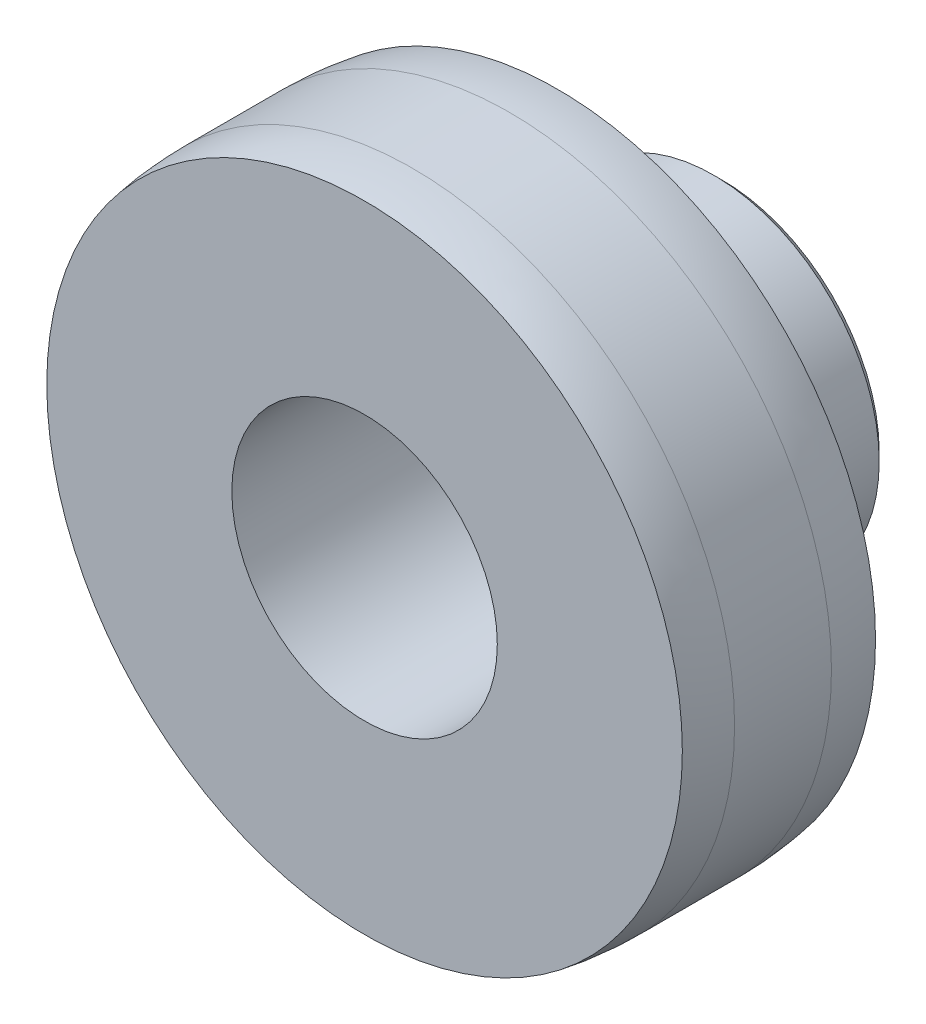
ISO-10303-21;
HEADER;
FILE_DESCRIPTION(('STEP AP214'),'2;1');
FILE_NAME('part.step','',(''),(''),'','','');
FILE_SCHEMA(('AUTOMOTIVE_DESIGN { 1 0 10303 214 1 1 1 1 }'));
ENDSEC;
DATA;
#1=APPLICATION_CONTEXT('core data for automotive mechanical design processes');
#2=APPLICATION_PROTOCOL_DEFINITION('international standard','automotive_design',2000,#1);
#3=PRODUCT_CONTEXT('',#1,'mechanical');
#4=PRODUCT('Part','Part','',(#3));
#5=PRODUCT_RELATED_PRODUCT_CATEGORY('part','',(#4));
#6=PRODUCT_DEFINITION_FORMATION('','',#4);
#7=PRODUCT_DEFINITION_CONTEXT('part definition',#1,'design');
#8=PRODUCT_DEFINITION('design','',#6,#7);
#9=PRODUCT_DEFINITION_SHAPE('','',#8);
#10=(LENGTH_UNIT() NAMED_UNIT(*) SI_UNIT(.MILLI.,.METRE.));
#11=(NAMED_UNIT(*) PLANE_ANGLE_UNIT() SI_UNIT($,.RADIAN.));
#12=(NAMED_UNIT(*) SI_UNIT($,.STERADIAN.) SOLID_ANGLE_UNIT());
#13=UNCERTAINTY_MEASURE_WITH_UNIT(LENGTH_MEASURE(1.E-05),#10,'distance_accuracy_value','');
#14=(GEOMETRIC_REPRESENTATION_CONTEXT(3) GLOBAL_UNCERTAINTY_ASSIGNED_CONTEXT((#13)) GLOBAL_UNIT_ASSIGNED_CONTEXT((#10,
#11,#12)) REPRESENTATION_CONTEXT('',''));
#15=CARTESIAN_POINT('',(0.,0.,0.));
#16=DIRECTION('',(0.,0.,1.));
#17=DIRECTION('',(1.,0.,0.));
#18=AXIS2_PLACEMENT_3D('',#15,#16,#17);
#19=CARTESIAN_POINT('',(0.,0.,16.4273848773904));
#20=DIRECTION('',(0.,0.,0.999999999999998));
#21=DIRECTION('',(1.,0.,0.));
#22=AXIS2_PLACEMENT_3D('',#19,#20,#21);
#23=CYLINDRICAL_SURFACE('',#22,8.25499999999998);
#24=CARTESIAN_POINT('',(0.,0.,-21.717));
#25=DIRECTION('',(0.,0.,0.999999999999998));
#26=DIRECTION('',(1.,0.,0.));
#27=AXIS2_PLACEMENT_3D('',#24,#25,#26);
#28=CIRCLE('',#27,8.25499999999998);
#29=CARTESIAN_POINT('',(-8.25499999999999,0.,-21.717));
#30=VERTEX_POINT('',#29);
#31=EDGE_CURVE('E72',#30,#30,#28,.F.);
#32=ORIENTED_EDGE('',*,*,#31,.T.);
#33=EDGE_LOOP('',(#32));
#34=FACE_BOUND('',#33,.T.);
#35=CARTESIAN_POINT('',(8.25499999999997,0.,-19.6088));
#36=CARTESIAN_POINT('',(8.25499829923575,-0.125839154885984,-19.608797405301));
#37=CARTESIAN_POINT('',(8.25209448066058,-0.251705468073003,-19.5983745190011));
#38=CARTESIAN_POINT('',(8.24079304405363,-0.499800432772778,-19.55703954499));
#39=CARTESIAN_POINT('',(8.23239308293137,-0.622027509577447,-19.5261187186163));
#40=CARTESIAN_POINT('',(8.21102451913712,-0.859227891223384,-19.4448791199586));
#41=CARTESIAN_POINT('',(8.19806206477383,-0.9742107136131,-19.3945864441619));
#42=CARTESIAN_POINT('',(8.16893165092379,-1.19411046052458,-19.2761306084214));
#43=CARTESIAN_POINT('',(8.15276341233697,-1.29902650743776,-19.2079658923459));
#44=CARTESIAN_POINT('',(8.11851175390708,-1.4984205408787,-19.0539142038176));
#45=CARTESIAN_POINT('',(8.10039361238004,-1.59261290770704,-18.9676652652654));
#46=CARTESIAN_POINT('',(8.06450231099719,-1.76539837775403,-18.7806664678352));
#47=CARTESIAN_POINT('',(8.04672919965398,-1.84398930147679,-18.6799145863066));
#48=CARTESIAN_POINT('',(8.01318163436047,-1.98476590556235,-18.4644497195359));
#49=CARTESIAN_POINT('',(7.99745080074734,-2.04661710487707,-18.3495107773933));
#50=CARTESIAN_POINT('',(7.97028195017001,-2.15000186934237,-18.1103585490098));
#51=CARTESIAN_POINT('',(7.95884307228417,-2.19153950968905,-17.9861471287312));
#52=CARTESIAN_POINT('',(7.94191276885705,-2.25211481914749,-17.7351527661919));
#53=CARTESIAN_POINT('',(7.93628402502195,-2.2716729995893,-17.6085049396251));
#54=CARTESIAN_POINT('',(7.9312015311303,-2.28935781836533,-17.3536102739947));
#55=CARTESIAN_POINT('',(7.93174652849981,-2.28748880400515,-17.2253637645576));
#56=CARTESIAN_POINT('',(7.93882738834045,-2.26278420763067,-16.9750238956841));
#57=CARTESIAN_POINT('',(7.94518144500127,-2.24058486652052,-16.8528617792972));
#58=CARTESIAN_POINT('',(7.96287248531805,-2.17687143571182,-16.6140678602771));
#59=CARTESIAN_POINT('',(7.97420989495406,-2.1353556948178,-16.4974365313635));
#60=CARTESIAN_POINT('',(8.00074562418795,-2.03368450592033,-16.2713869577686));
#61=CARTESIAN_POINT('',(8.01598871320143,-1.97331101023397,-16.1620722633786));
#62=CARTESIAN_POINT('',(8.04859498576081,-1.83579000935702,-15.9549049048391));
#63=CARTESIAN_POINT('',(8.06595861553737,-1.75863897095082,-15.8570546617));
#64=CARTESIAN_POINT('',(8.10160058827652,-1.58652731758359,-15.6719662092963));
#65=CARTESIAN_POINT('',(8.11988958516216,-1.4910342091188,-15.5852244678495));
#66=CARTESIAN_POINT('',(8.15477394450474,-1.28663153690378,-15.4288803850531));
#67=CARTESIAN_POINT('',(8.1713692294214,-1.17772135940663,-15.3592788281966));
#68=CARTESIAN_POINT('',(8.20111204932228,-0.948767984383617,-15.2389482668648));
#69=CARTESIAN_POINT('',(8.2142419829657,-0.828671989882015,-15.1883150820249));
#70=CARTESIAN_POINT('',(8.23544774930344,-0.581224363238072,-15.1081038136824));
#71=CARTESIAN_POINT('',(8.24352477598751,-0.45387445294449,-15.0785207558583));
#72=CARTESIAN_POINT('',(8.25353162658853,-0.19976603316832,-15.042042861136));
#73=CARTESIAN_POINT('',(8.25564409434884,-0.0731113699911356,-15.0344737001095));
#74=CARTESIAN_POINT('',(8.25401209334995,0.179659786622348,-15.0403680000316));
#75=CARTESIAN_POINT('',(8.25026828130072,0.305776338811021,-15.053829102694));
#76=CARTESIAN_POINT('',(8.23746288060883,0.551443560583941,-15.1008507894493));
#77=CARTESIAN_POINT('',(8.22850227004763,0.671072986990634,-15.1340299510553));
#78=CARTESIAN_POINT('',(8.20628491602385,0.903052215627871,-15.2190982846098));
#79=CARTESIAN_POINT('',(8.19302768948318,1.01540119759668,-15.2709895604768));
#80=CARTESIAN_POINT('',(8.16326623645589,1.23220964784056,-15.3932242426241));
#81=CARTESIAN_POINT('',(8.14670046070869,1.33645758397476,-15.4639274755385));
#82=CARTESIAN_POINT('',(8.11223385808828,1.53184414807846,-15.6213313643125));
#83=CARTESIAN_POINT('',(8.09433274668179,1.62297996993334,-15.7080354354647));
#84=CARTESIAN_POINT('',(8.05853209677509,1.79243581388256,-15.8981347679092));
#85=CARTESIAN_POINT('',(8.04064935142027,1.87027861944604,-16.0019594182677));
#86=CARTESIAN_POINT('',(8.00750602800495,2.00745382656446,-16.221580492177));
#87=CARTESIAN_POINT('',(7.99224534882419,2.06678694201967,-16.3373764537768));
#88=CARTESIAN_POINT('',(7.96625178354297,2.16481667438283,-16.5771211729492));
#89=CARTESIAN_POINT('',(7.95549373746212,2.20362829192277,-16.7010200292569));
#90=CARTESIAN_POINT('',(7.93973470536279,2.25975750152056,-16.9539381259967));
#91=CARTESIAN_POINT('',(7.93473210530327,2.27708111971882,-17.0829559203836));
#92=CARTESIAN_POINT('',(7.93119257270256,2.28937642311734,-17.3375434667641));
#93=CARTESIAN_POINT('',(7.93243288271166,2.28511814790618,-17.4630734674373));
#94=CARTESIAN_POINT('',(7.94071370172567,2.25617214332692,-17.7115506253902));
#95=CARTESIAN_POINT('',(7.94775403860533,2.23148502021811,-17.8344978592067));
#96=CARTESIAN_POINT('',(7.96670385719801,2.16284431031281,-18.0732649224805));
#97=CARTESIAN_POINT('',(7.97856898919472,2.11906595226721,-18.1891388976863));
#98=CARTESIAN_POINT('',(8.00582960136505,2.01362103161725,-18.4119871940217));
#99=CARTESIAN_POINT('',(8.02122567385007,1.95195146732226,-18.5189600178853));
#100=CARTESIAN_POINT('',(8.0544198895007,1.81019205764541,-18.7246151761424));
#101=CARTESIAN_POINT('',(8.07227848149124,1.72958255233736,-18.8229295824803));
#102=CARTESIAN_POINT('',(8.10806182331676,1.55320400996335,-19.0048860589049));
#103=CARTESIAN_POINT('',(8.12598658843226,1.45743122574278,-19.0885244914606));
#104=CARTESIAN_POINT('',(8.16038932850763,1.25071662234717,-19.2407052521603));
#105=CARTESIAN_POINT('',(8.1768231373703,1.13946997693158,-19.308844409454));
#106=CARTESIAN_POINT('',(8.20589661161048,0.90664675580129,-19.4253482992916));
#107=CARTESIAN_POINT('',(8.21853852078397,0.785076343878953,-19.4737247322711));
#108=CARTESIAN_POINT('',(8.23712346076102,0.553437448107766,-19.543594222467));
#109=CARTESIAN_POINT('',(8.24377643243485,0.444292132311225,-19.5679869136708));
#110=CARTESIAN_POINT('',(8.25271520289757,0.223438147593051,-19.6005900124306));
#111=CARTESIAN_POINT('',(8.25500151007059,0.111729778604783,-19.6088023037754));
#112=CARTESIAN_POINT('',(8.25499999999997,0.,-19.6088));
#113=B_SPLINE_CURVE_WITH_KNOTS('',3,(#35,#36,#37,#38,#39,#40,#41,#42,#43,#44,#45,#46,#47,#48,
#49,#50,#51,#52,#53,#54,#55,#56,#57,#58,#59,#60,#61,#62,#63,#64,#65,#66,#67,#68,#69,#70,#71,#72,
#73,#74,#75,#76,#77,#78,#79,#80,#81,#82,#83,#84,#85,#86,#87,#88,#89,#90,#91,#92,#93,#94,#95,#96,
#97,#98,#99,#100,#101,#102,#103,#104,#105,#106,#107,#108,#109,#110,#111,#112),.UNSPECIFIED.,.T.,
.F.,(4,2,2,2,2,2,2,2,2,2,2,2,2,2,2,2,2,2,2,2,2,2,2,2,2,2,2,2,2,2,2,2,2,2,2,2,2,2,4),(0.,
0.377107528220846,0.754375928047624,1.13113786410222,1.50793261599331,1.89314676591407,
2.27841469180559,2.67089151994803,3.06328957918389,3.44618512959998,3.82900299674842,
4.20023532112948,4.57149938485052,4.94722597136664,5.3230317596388,5.71210205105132,
6.1011901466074,6.4922180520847,6.88315352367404,7.26198089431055,7.64076578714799,
8.01245168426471,8.38417938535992,8.7636041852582,9.14311006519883,9.53422298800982,
9.92532082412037,10.3142031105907,10.702976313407,11.0779779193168,11.452968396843,
11.8245871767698,12.1962683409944,12.5796731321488,12.9631728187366,13.3557295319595,
13.7480534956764,14.0829178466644,14.4177432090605),.UNSPECIFIED.);
#114=CARTESIAN_POINT('',(8.25499999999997,0.,-19.6088));
#115=VERTEX_POINT('',#114);
#116=EDGE_CURVE('E128',#115,#115,#113,.T.);
#117=ORIENTED_EDGE('',*,*,#116,.F.);
#118=EDGE_LOOP('',(#117));
#119=FACE_BOUND('',#118,.T.);
#120=CARTESIAN_POINT('',(0.,0.,0.));
#121=DIRECTION('',(0.,0.,0.999999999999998));
#122=DIRECTION('',(1.,0.,0.));
#123=AXIS2_PLACEMENT_3D('',#120,#121,#122);
#124=CIRCLE('',#123,8.25499999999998);
#125=CARTESIAN_POINT('',(8.255,0.,0.));
#126=VERTEX_POINT('',#125);
#127=EDGE_CURVE('E298',#126,#126,#124,.T.);
#128=ORIENTED_EDGE('',*,*,#127,.T.);
#129=EDGE_LOOP('',(#128));
#130=FACE_BOUND('',#129,.T.);
#131=CARTESIAN_POINT('',(0.,8.25499999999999,-19.5707));
#132=CARTESIAN_POINT('',(0.125839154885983,8.25499829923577,-19.570697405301));
#133=CARTESIAN_POINT('',(0.251705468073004,8.25209448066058,-19.5602745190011));
#134=CARTESIAN_POINT('',(0.499800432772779,8.24079304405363,-19.51893954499));
#135=CARTESIAN_POINT('',(0.622027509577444,8.23239308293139,-19.4880187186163));
#136=CARTESIAN_POINT('',(0.859227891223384,8.21102451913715,-19.4067791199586));
#137=CARTESIAN_POINT('',(0.974210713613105,8.19806206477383,-19.3564864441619));
#138=CARTESIAN_POINT('',(1.19411046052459,8.16893165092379,-19.2380306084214));
#139=CARTESIAN_POINT('',(1.29902650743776,8.152763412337,-19.169865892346));
#140=CARTESIAN_POINT('',(1.49842054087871,8.11851175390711,-19.0158142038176));
#141=CARTESIAN_POINT('',(1.59261290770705,8.10039361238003,-18.9295652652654));
#142=CARTESIAN_POINT('',(1.76539837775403,8.06450231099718,-18.7425664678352));
#143=CARTESIAN_POINT('',(1.84398930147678,8.046729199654,-18.6418145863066));
#144=CARTESIAN_POINT('',(1.98476590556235,8.0131816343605,-18.4263497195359));
#145=CARTESIAN_POINT('',(2.04661710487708,7.99745080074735,-18.3114107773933));
#146=CARTESIAN_POINT('',(2.15000186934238,7.97028195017,-18.0722585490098));
#147=CARTESIAN_POINT('',(2.19153950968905,7.95884307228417,-17.9480471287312));
#148=CARTESIAN_POINT('',(2.25211481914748,7.94191276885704,-17.6970527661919));
#149=CARTESIAN_POINT('',(2.2716729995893,7.93628402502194,-17.5704049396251));
#150=CARTESIAN_POINT('',(2.28935781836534,7.9312015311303,-17.3155102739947));
#151=CARTESIAN_POINT('',(2.28748880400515,7.93174652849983,-17.1872637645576));
#152=CARTESIAN_POINT('',(2.26278420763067,7.93882738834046,-16.9369238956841));
#153=CARTESIAN_POINT('',(2.24058486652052,7.94518144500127,-16.8147617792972));
#154=CARTESIAN_POINT('',(2.17687143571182,7.96287248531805,-16.5759678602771));
#155=CARTESIAN_POINT('',(2.1353556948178,7.97420989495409,-16.4593365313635));
#156=CARTESIAN_POINT('',(2.03368450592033,8.00074562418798,-16.2332869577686));
#157=CARTESIAN_POINT('',(1.97331101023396,8.01598871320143,-16.1239722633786));
#158=CARTESIAN_POINT('',(1.83579000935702,8.04859498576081,-15.9168049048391));
#159=CARTESIAN_POINT('',(1.75863897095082,8.06595861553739,-15.8189546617));
#160=CARTESIAN_POINT('',(1.58652731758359,8.10160058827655,-15.6338662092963));
#161=CARTESIAN_POINT('',(1.49103420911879,8.11988958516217,-15.5471244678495));
#162=CARTESIAN_POINT('',(1.28663153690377,8.15477394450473,-15.3907803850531));
#163=CARTESIAN_POINT('',(1.17772135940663,8.17136922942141,-15.3211788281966));
#164=CARTESIAN_POINT('',(0.948767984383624,8.20111204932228,-15.2008482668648));
#165=CARTESIAN_POINT('',(0.828671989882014,8.21424198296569,-15.1502150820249));
#166=CARTESIAN_POINT('',(0.581224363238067,8.23544774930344,-15.0700038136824));
#167=CARTESIAN_POINT('',(0.45387445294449,8.24352477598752,-15.0404207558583));
#168=CARTESIAN_POINT('',(0.199766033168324,8.25353162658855,-15.003942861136));
#169=CARTESIAN_POINT('',(0.0731113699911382,8.25564409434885,-14.9963737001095));
#170=CARTESIAN_POINT('',(-0.179659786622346,8.25401209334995,-15.0022680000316));
#171=CARTESIAN_POINT('',(-0.305776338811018,8.25026828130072,-15.015729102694));
#172=CARTESIAN_POINT('',(-0.551443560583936,8.23746288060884,-15.0627507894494));
#173=CARTESIAN_POINT('',(-0.671072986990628,8.22850227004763,-15.0959299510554));
#174=CARTESIAN_POINT('',(-0.903052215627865,8.20628491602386,-15.1809982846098));
#175=CARTESIAN_POINT('',(-1.01540119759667,8.19302768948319,-15.2328895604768));
#176=CARTESIAN_POINT('',(-1.23220964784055,8.16326623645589,-15.3551242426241));
#177=CARTESIAN_POINT('',(-1.33645758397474,8.14670046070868,-15.4258274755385));
#178=CARTESIAN_POINT('',(-1.53184414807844,8.11223385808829,-15.5832313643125));
#179=CARTESIAN_POINT('',(-1.62297996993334,8.09433274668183,-15.6699354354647));
#180=CARTESIAN_POINT('',(-1.79243581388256,8.05853209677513,-15.8600347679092));
#181=CARTESIAN_POINT('',(-1.87027861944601,8.04064935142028,-15.9638594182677));
#182=CARTESIAN_POINT('',(-2.00745382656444,8.00750602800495,-16.183480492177));
#183=CARTESIAN_POINT('',(-2.06678694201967,7.9922453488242,-16.2992764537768));
#184=CARTESIAN_POINT('',(-2.16481667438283,7.96625178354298,-16.5390211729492));
#185=CARTESIAN_POINT('',(-2.20362829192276,7.95549373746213,-16.6629200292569));
#186=CARTESIAN_POINT('',(-2.25975750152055,7.93973470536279,-16.9158381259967));
#187=CARTESIAN_POINT('',(-2.27708111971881,7.93473210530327,-17.0448559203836));
#188=CARTESIAN_POINT('',(-2.28937642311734,7.93119257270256,-17.2994434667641));
#189=CARTESIAN_POINT('',(-2.28511814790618,7.93243288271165,-17.4249734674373));
#190=CARTESIAN_POINT('',(-2.25617214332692,7.94071370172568,-17.6734506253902));
#191=CARTESIAN_POINT('',(-2.23148502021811,7.94775403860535,-17.7963978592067));
#192=CARTESIAN_POINT('',(-2.16284431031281,7.96670385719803,-18.0351649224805));
#193=CARTESIAN_POINT('',(-2.11906595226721,7.97856898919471,-18.1510388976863));
#194=CARTESIAN_POINT('',(-2.01362103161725,8.00582960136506,-18.3738871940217));
#195=CARTESIAN_POINT('',(-1.95195146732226,8.0212256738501,-18.4808600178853));
#196=CARTESIAN_POINT('',(-1.81019205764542,8.05441988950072,-18.6865151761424));
#197=CARTESIAN_POINT('',(-1.72958255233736,8.07227848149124,-18.7848295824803));
#198=CARTESIAN_POINT('',(-1.55320400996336,8.10806182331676,-18.9667860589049));
#199=CARTESIAN_POINT('',(-1.45743122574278,8.12598658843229,-19.0504244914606));
#200=CARTESIAN_POINT('',(-1.25071662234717,8.16038932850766,-19.2026052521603));
#201=CARTESIAN_POINT('',(-1.13946997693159,8.1768231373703,-19.270744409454));
#202=CARTESIAN_POINT('',(-0.906646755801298,8.20589661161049,-19.3872482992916));
#203=CARTESIAN_POINT('',(-0.785076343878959,8.21853852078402,-19.4356247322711));
#204=CARTESIAN_POINT('',(-0.553437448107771,8.23712346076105,-19.505494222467));
#205=CARTESIAN_POINT('',(-0.444292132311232,8.24377643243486,-19.5298869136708));
#206=CARTESIAN_POINT('',(-0.223438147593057,8.25271520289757,-19.5624900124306));
#207=CARTESIAN_POINT('',(-0.111729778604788,8.2550015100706,-19.5707023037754));
#208=CARTESIAN_POINT('',(0.,8.25499999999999,-19.5707));
#209=B_SPLINE_CURVE_WITH_KNOTS('',3,(#131,#132,#133,#134,#135,#136,#137,#138,#139,#140,#141,
#142,#143,#144,#145,#146,#147,#148,#149,#150,#151,#152,#153,#154,#155,#156,#157,#158,#159,#160,
#161,#162,#163,#164,#165,#166,#167,#168,#169,#170,#171,#172,#173,#174,#175,#176,#177,#178,#179,
#180,#181,#182,#183,#184,#185,#186,#187,#188,#189,#190,#191,#192,#193,#194,#195,#196,#197,#198,
#199,#200,#201,#202,#203,#204,#205,#206,#207,#208),.UNSPECIFIED.,.T.,.F.,(4,2,2,2,2,2,2,2,2,2,2,
2,2,2,2,2,2,2,2,2,2,2,2,2,2,2,2,2,2,2,2,2,2,2,2,2,2,2,4),(0.,0.377107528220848,
0.754375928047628,1.13113786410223,1.50793261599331,1.89314676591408,2.27841469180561,
2.67089151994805,3.06328957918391,3.44618512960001,3.82900299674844,4.20023532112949,
4.57149938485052,4.94722597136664,5.32303175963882,5.71210205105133,6.10119014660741,
6.4922180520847,6.88315352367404,7.26198089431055,7.64076578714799,8.01245168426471,
8.38417938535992,8.76360418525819,9.1431100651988,9.53422298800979,9.92532082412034,
10.3142031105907,10.702976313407,11.0779779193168,11.452968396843,11.8245871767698,
12.1962683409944,12.5796731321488,12.9631728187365,13.3557295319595,13.7480534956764,
14.0829178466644,14.4177432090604),.UNSPECIFIED.);
#210=CARTESIAN_POINT('',(0.,8.25499999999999,-19.5707));
#211=VERTEX_POINT('',#210);
#212=EDGE_CURVE('E135',#211,#211,#209,.T.);
#213=ORIENTED_EDGE('',*,*,#212,.F.);
#214=EDGE_LOOP('',(#213));
#215=FACE_BOUND('',#214,.T.);
#216=ADVANCED_FACE('F40',(#34,#119,#130,#215),#23,.F.);
#217=CARTESIAN_POINT('',(0.,0.,16.4273848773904));
#218=DIRECTION('',(0.,0.,0.999999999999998));
#219=DIRECTION('',(1.,0.,0.));
#220=AXIS2_PLACEMENT_3D('',#217,#218,#219);
#221=CYLINDRICAL_SURFACE('',#220,10.287);
#222=CARTESIAN_POINT('',(10.287,0.,-14.9769593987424));
#223=CARTESIAN_POINT('',(10.2870011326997,-0.0388884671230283,-14.9769534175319));
#224=CARTESIAN_POINT('',(10.28675352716,-0.0777752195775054,-14.9779437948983));
#225=CARTESIAN_POINT('',(10.2857866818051,-0.155393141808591,-14.9818822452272));
#226=CARTESIAN_POINT('',(10.2850680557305,-0.194124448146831,-14.9848277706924));
#227=CARTESIAN_POINT('',(10.2831856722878,-0.271348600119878,-14.9926383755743));
#228=CARTESIAN_POINT('',(10.2820222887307,-0.309841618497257,-14.9975018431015));
#229=CARTESIAN_POINT('',(10.2792771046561,-0.386507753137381,-15.0091093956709));
#230=CARTESIAN_POINT('',(10.2776955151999,-0.424681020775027,-15.0158525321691));
#231=CARTESIAN_POINT('',(10.2741404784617,-0.50062589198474,-15.0311810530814));
#232=CARTESIAN_POINT('',(10.2721671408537,-0.538397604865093,-15.0397659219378));
#233=CARTESIAN_POINT('',(10.267855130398,-0.613457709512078,-15.0587396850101));
#234=CARTESIAN_POINT('',(10.2655165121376,-0.650746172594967,-15.0691283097));
#235=CARTESIAN_POINT('',(10.2605004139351,-0.724758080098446,-15.0916715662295));
#236=CARTESIAN_POINT('',(10.2578229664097,-0.761481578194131,-15.1038260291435));
#237=CARTESIAN_POINT('',(10.2521556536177,-0.834281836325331,-15.129863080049));
#238=CARTESIAN_POINT('',(10.24916581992,-0.870358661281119,-15.1437454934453));
#239=CARTESIAN_POINT('',(10.2429001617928,-0.941783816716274,-15.1732006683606));
#240=CARTESIAN_POINT('',(10.2396243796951,-0.977132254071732,-15.1887731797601));
#241=CARTESIAN_POINT('',(10.2328132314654,-1.04701884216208,-15.2215708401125));
#242=CARTESIAN_POINT('',(10.2292779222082,-1.08155716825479,-15.2387956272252));
#243=CARTESIAN_POINT('',(10.2219741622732,-1.14974171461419,-15.2748601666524));
#244=CARTESIAN_POINT('',(10.2182057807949,-1.18338819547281,-15.2936994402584));
#245=CARTESIAN_POINT('',(10.2104621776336,-1.24970720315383,-15.3329552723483));
#246=CARTESIAN_POINT('',(10.2064870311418,-1.28238007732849,-15.3533712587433));
#247=CARTESIAN_POINT('',(10.1983567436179,-1.34667006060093,-15.3957428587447));
#248=CARTESIAN_POINT('',(10.1942016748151,-1.37828758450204,-15.4176978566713));
#249=CARTESIAN_POINT('',(10.1857363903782,-1.44038493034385,-15.4631096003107));
#250=CARTESIAN_POINT('',(10.1814262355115,-1.47086518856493,-15.4865657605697));
#251=CARTESIAN_POINT('',(10.1726831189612,-1.53060665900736,-15.5349425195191));
#252=CARTESIAN_POINT('',(10.1682501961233,-1.55986824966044,-15.5598626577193));
#253=CARTESIAN_POINT('',(10.1592659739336,-1.61708909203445,-15.6111275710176));
#254=CARTESIAN_POINT('',(10.1547146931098,-1.64504854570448,-15.6374721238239));
#255=CARTESIAN_POINT('',(10.1456053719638,-1.69957141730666,-15.6915369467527));
#256=CARTESIAN_POINT('',(10.1410473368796,-1.72613561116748,-15.7192564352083));
#257=CARTESIAN_POINT('',(10.1320380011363,-1.77781707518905,-15.7759809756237));
#258=CARTESIAN_POINT('',(10.1275866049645,-1.80293567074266,-15.8049848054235));
#259=CARTESIAN_POINT('',(10.1187966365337,-1.8516878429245,-15.8641955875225));
#260=CARTESIAN_POINT('',(10.1144579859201,-1.87532246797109,-15.8944016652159));
#261=CARTESIAN_POINT('',(10.1059274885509,-1.92107050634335,-15.9559370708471));
#262=CARTESIAN_POINT('',(10.1017355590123,-1.94318478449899,-15.98726574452));
#263=CARTESIAN_POINT('',(10.0935250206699,-1.98585529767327,-16.0509659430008));
#264=CARTESIAN_POINT('',(10.0895063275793,-2.00641229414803,-16.0833369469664));
#265=CARTESIAN_POINT('',(10.0816707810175,-2.0459314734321,-16.1490416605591));
#266=CARTESIAN_POINT('',(10.0778538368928,-2.06489437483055,-16.182374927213));
#267=CARTESIAN_POINT('',(10.0704497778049,-2.10118849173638,-16.2499240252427));
#268=CARTESIAN_POINT('',(10.0668625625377,-2.11852042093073,-16.2841394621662));
#269=CARTESIAN_POINT('',(10.059946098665,-2.15151569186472,-16.3533727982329));
#270=CARTESIAN_POINT('',(10.0566167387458,-2.16717975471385,-16.3883903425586));
#271=CARTESIAN_POINT('',(10.0502440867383,-2.19680237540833,-16.4591477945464));
#272=CARTESIAN_POINT('',(10.0472006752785,-2.21076164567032,-16.4948873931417));
#273=CARTESIAN_POINT('',(10.0414280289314,-2.23693777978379,-16.5670088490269));
#274=CARTESIAN_POINT('',(10.0386986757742,-2.24915529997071,-16.6033904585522));
#275=CARTESIAN_POINT('',(10.033582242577,-2.27181108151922,-16.6767158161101));
#276=CARTESIAN_POINT('',(10.0311950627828,-2.28224986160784,-16.7136593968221));
#277=CARTESIAN_POINT('',(10.0267910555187,-2.30131138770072,-16.7880285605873));
#278=CARTESIAN_POINT('',(10.024774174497,-2.30993439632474,-16.8254540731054));
#279=CARTESIAN_POINT('',(10.021138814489,-2.32532774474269,-16.9007069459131));
#280=CARTESIAN_POINT('',(10.0195203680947,-2.33209793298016,-16.9385343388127));
#281=CARTESIAN_POINT('',(10.0167098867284,-2.34374909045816,-17.0145108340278));
#282=CARTESIAN_POINT('',(10.015518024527,-2.34862929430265,-17.0526600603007));
#283=CARTESIAN_POINT('',(10.0135886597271,-2.35646441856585,-17.1292000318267));
#284=CARTESIAN_POINT('',(10.0128515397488,-2.35941771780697,-17.1675909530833));
#285=CARTESIAN_POINT('',(10.0118595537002,-2.36336215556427,-17.2445344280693));
#286=CARTESIAN_POINT('',(10.0116053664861,-2.36435053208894,-17.2830871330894));
#287=CARTESIAN_POINT('',(10.0116069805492,-2.36433250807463,-17.3602001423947));
#288=CARTESIAN_POINT('',(10.0118628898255,-2.36332568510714,-17.3987604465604));
#289=CARTESIAN_POINT('',(10.0128580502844,-2.35935067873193,-17.4757335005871));
#290=CARTESIAN_POINT('',(10.0135968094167,-2.35638449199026,-17.5141463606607));
#291=CARTESIAN_POINT('',(10.0155292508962,-2.34852745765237,-17.5907429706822));
#292=CARTESIAN_POINT('',(10.0167227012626,-2.34363759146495,-17.6289268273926));
#293=CARTESIAN_POINT('',(10.0195361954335,-2.33197061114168,-17.7049837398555));
#294=CARTESIAN_POINT('',(10.0211561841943,-2.32519374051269,-17.7428568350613));
#295=CARTESIAN_POINT('',(10.0247945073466,-2.30978961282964,-17.8182106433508));
#296=CARTESIAN_POINT('',(10.0268128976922,-2.3011620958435,-17.8556913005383));
#297=CARTESIAN_POINT('',(10.0312198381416,-2.28209338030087,-17.9301786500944));
#298=CARTESIAN_POINT('',(10.0336085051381,-2.27165160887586,-17.9671851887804));
#299=CARTESIAN_POINT('',(10.0387278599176,-2.24899088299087,-18.0406427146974));
#300=CARTESIAN_POINT('',(10.0414586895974,-2.2367711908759,-18.0770934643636));
#301=CARTESIAN_POINT('',(10.047234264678,-2.21059098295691,-18.1493578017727));
#302=CARTESIAN_POINT('',(10.0502791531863,-2.19662967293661,-18.1851710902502));
#303=CARTESIAN_POINT('',(10.0566547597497,-2.16700248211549,-18.2560788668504));
#304=CARTESIAN_POINT('',(10.0599856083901,-2.15133582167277,-18.2911730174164));
#305=CARTESIAN_POINT('',(10.0669050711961,-2.11833411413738,-18.3605608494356));
#306=CARTESIAN_POINT('',(10.070493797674,-2.10099833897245,-18.3948541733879));
#307=CARTESIAN_POINT('',(10.0779009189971,-2.0646945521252,-18.462558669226));
#308=CARTESIAN_POINT('',(10.0817194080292,-2.0457258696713,-18.4959694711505));
#309=CARTESIAN_POINT('',(10.0895580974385,-2.00619240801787,-18.56182720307));
#310=CARTESIAN_POINT('',(10.0935783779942,-1.98562699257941,-18.5942737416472));
#311=CARTESIAN_POINT('',(10.1017921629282,-1.94293624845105,-18.65812133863));
#312=CARTESIAN_POINT('',(10.1059857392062,-1.92081026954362,-18.6895219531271));
#313=CARTESIAN_POINT('',(10.1145195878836,-1.8750345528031,-18.7511957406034));
#314=CARTESIAN_POINT('',(10.1188599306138,-1.85138407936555,-18.7814683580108));
#315=CARTESIAN_POINT('',(10.1276534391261,-1.80259588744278,-18.8408056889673));
#316=CARTESIAN_POINT('',(10.1321066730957,-1.77745725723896,-18.8698696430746));
#317=CARTESIAN_POINT('',(10.1411195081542,-1.72572827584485,-18.9267039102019));
#318=CARTESIAN_POINT('',(10.1456791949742,-1.69913672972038,-18.9544731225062));
#319=CARTESIAN_POINT('',(10.1547914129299,-1.6445692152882,-19.0086249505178));
#320=CARTESIAN_POINT('',(10.159343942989,-1.61659305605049,-19.035007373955));
#321=CARTESIAN_POINT('',(10.1683299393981,-1.55936248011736,-19.0863354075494));
#322=CARTESIAN_POINT('',(10.172763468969,-1.53010876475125,-19.1112817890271));
#323=CARTESIAN_POINT('',(10.1815068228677,-1.47040027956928,-19.1596976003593));
#324=CARTESIAN_POINT('',(10.1858166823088,-1.43994585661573,-19.1831674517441));
#325=CARTESIAN_POINT('',(10.1942806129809,-1.37791397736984,-19.228595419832));
#326=CARTESIAN_POINT('',(10.1984347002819,-1.34633663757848,-19.2505536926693));
#327=CARTESIAN_POINT('',(10.2065623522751,-1.28213656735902,-19.2929221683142));
#328=CARTESIAN_POINT('',(10.2105359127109,-1.24951381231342,-19.3133323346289));
#329=CARTESIAN_POINT('',(10.2182758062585,-1.18330054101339,-19.3525685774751));
#330=CARTESIAN_POINT('',(10.2220421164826,-1.14970991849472,-19.3713944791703));
#331=CARTESIAN_POINT('',(10.2293413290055,-1.08163846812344,-19.4074260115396));
#332=CARTESIAN_POINT('',(10.2328741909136,-1.04715748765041,-19.4246313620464));
#333=CARTESIAN_POINT('',(10.2396801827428,-0.977382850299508,-19.4573856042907));
#334=CARTESIAN_POINT('',(10.242953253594,-0.942089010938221,-19.4729341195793));
#335=CARTESIAN_POINT('',(10.2492133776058,-0.87076616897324,-19.5023384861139));
#336=CARTESIAN_POINT('',(10.2522003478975,-0.834736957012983,-19.5161938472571));
#337=CARTESIAN_POINT('',(10.2578619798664,-0.762020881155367,-19.5421757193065));
#338=CARTESIAN_POINT('',(10.2605365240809,-0.725333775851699,-19.5543015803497));
#339=CARTESIAN_POINT('',(10.265547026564,-0.651379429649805,-19.5767883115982));
#340=CARTESIAN_POINT('',(10.2678828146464,-0.61411190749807,-19.5871482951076));
#341=CARTESIAN_POINT('',(10.2721895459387,-0.539074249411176,-19.6060672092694));
#342=CARTESIAN_POINT('',(10.2741602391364,-0.501303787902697,-19.6146249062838));
#343=CARTESIAN_POINT('',(10.2777105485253,-0.425337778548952,-19.6299032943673));
#344=CARTESIAN_POINT('',(10.2792897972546,-0.387141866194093,-19.6366222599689));
#345=CARTESIAN_POINT('',(10.2820310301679,-0.310402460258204,-19.6481873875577));
#346=CARTESIAN_POINT('',(10.2831924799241,-0.271858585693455,-19.6530311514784));
#347=CARTESIAN_POINT('',(10.2850719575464,-0.194500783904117,-19.6608102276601));
#348=CARTESIAN_POINT('',(10.2857892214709,-0.155686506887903,-19.6637422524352));
#349=CARTESIAN_POINT('',(10.2867543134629,-0.0778651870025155,-19.6676625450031));
#350=CARTESIAN_POINT('',(10.2870010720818,-0.0388579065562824,-19.6686463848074));
#351=CARTESIAN_POINT('',(10.2869989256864,0.0391587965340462,-19.6686348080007));
#352=CARTESIAN_POINT('',(10.2867499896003,0.0781682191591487,-19.6676392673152));
#353=CARTESIAN_POINT('',(10.2857801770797,0.155997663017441,-19.6636950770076));
#354=CARTESIAN_POINT('',(10.285060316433,0.194817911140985,-19.6607506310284));
#355=CARTESIAN_POINT('',(10.283175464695,0.272190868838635,-19.6529464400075));
#356=CARTESIAN_POINT('',(10.2820111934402,0.310743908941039,-19.6480897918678));
#357=CARTESIAN_POINT('',(10.2792641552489,0.387504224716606,-19.63649857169));
#358=CARTESIAN_POINT('',(10.2776818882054,0.425711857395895,-19.6297662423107));
#359=CARTESIAN_POINT('',(10.274125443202,0.501703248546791,-19.6144608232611));
#360=CARTESIAN_POINT('',(10.2721516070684,0.539487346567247,-19.6058893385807));
#361=CARTESIAN_POINT('',(10.2678385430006,0.614553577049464,-19.5869425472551));
#362=CARTESIAN_POINT('',(10.2654995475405,0.651836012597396,-19.5765683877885));
#363=CARTESIAN_POINT('',(10.2604826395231,0.725820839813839,-19.5540530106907));
#364=CARTESIAN_POINT('',(10.2578048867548,0.762523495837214,-19.5419126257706));
#365=CARTESIAN_POINT('',(10.2521369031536,0.835270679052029,-19.5159014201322));
#366=CARTESIAN_POINT('',(10.2491467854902,0.871315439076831,-19.5020312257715));
#367=CARTESIAN_POINT('',(10.2428804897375,0.942668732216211,-19.4725969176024));
#368=CARTESIAN_POINT('',(10.2396043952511,0.977977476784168,-19.4570332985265));
#369=CARTESIAN_POINT('',(10.2327925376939,1.04778062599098,-19.4242485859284));
#370=CARTESIAN_POINT('',(10.2292568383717,1.08227522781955,-19.407027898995));
#371=CARTESIAN_POINT('',(10.2219521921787,1.15037196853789,-19.3709654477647));
#372=CARTESIAN_POINT('',(10.2181832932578,1.18397428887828,-19.352124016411));
#373=CARTESIAN_POINT('',(10.2104385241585,1.25020834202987,-19.3128564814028));
#374=CARTESIAN_POINT('',(10.206462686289,1.28284022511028,-19.2924306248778));
#375=CARTESIAN_POINT('',(10.1983308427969,1.34705529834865,-19.2500305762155));
#376=CARTESIAN_POINT('',(10.1941748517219,1.3786385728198,-19.2280565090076));
#377=CARTESIAN_POINT('',(10.1857075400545,1.44067834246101,-19.1825967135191));
#378=CARTESIAN_POINT('',(10.1813962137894,1.47113479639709,-19.159110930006));
#379=CARTESIAN_POINT('',(10.1726504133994,1.53084296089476,-19.1106633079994));
#380=CARTESIAN_POINT('',(10.1682159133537,1.56009441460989,-19.0857011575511));
#381=CARTESIAN_POINT('',(10.1592285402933,1.61731447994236,-19.0343406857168));
#382=CARTESIAN_POINT('',(10.1546756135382,1.64528249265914,-19.007941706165));
#383=CARTESIAN_POINT('',(10.1455634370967,1.69982904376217,-18.9537611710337));
#384=CARTESIAN_POINT('',(10.1410041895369,1.72640796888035,-18.9259800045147));
#385=CARTESIAN_POINT('',(10.1319931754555,1.77810927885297,-18.8691304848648));
#386=CARTESIAN_POINT('',(10.1275413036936,1.80323312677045,-18.840063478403));
#387=CARTESIAN_POINT('',(10.1187513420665,1.85198891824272,-18.7807267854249));
#388=CARTESIAN_POINT('',(10.1144131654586,1.87562201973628,-18.7504580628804));
#389=CARTESIAN_POINT('',(10.1058843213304,1.92136099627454,-18.6887981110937));
#390=CARTESIAN_POINT('',(10.1016935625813,1.94346782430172,-18.6574076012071));
#391=CARTESIAN_POINT('',(10.0934859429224,1.9861187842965,-18.5935852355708));
#392=CARTESIAN_POINT('',(10.0894689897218,2.00666375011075,-18.5611539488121));
#393=CARTESIAN_POINT('',(10.0816373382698,2.04615543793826,-18.4953308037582));
#394=CARTESIAN_POINT('',(10.0778225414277,2.06510294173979,-18.4619394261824));
#395=CARTESIAN_POINT('',(10.0704230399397,2.1013640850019,-18.3942768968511));
#396=CARTESIAN_POINT('',(10.0668382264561,2.11867849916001,-18.360006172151));
#397=CARTESIAN_POINT('',(10.0599266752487,2.15163779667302,-18.2906656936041));
#398=CARTESIAN_POINT('',(10.0565998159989,2.16728346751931,-18.2555963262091));
#399=CARTESIAN_POINT('',(10.0502321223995,2.19686959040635,-18.184739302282));
#400=CARTESIAN_POINT('',(10.0471911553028,2.21081083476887,-18.1489519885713));
#401=CARTESIAN_POINT('',(10.0414232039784,2.23695242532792,-18.0767398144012));
#402=CARTESIAN_POINT('',(10.0386960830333,2.24915353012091,-18.0403152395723));
#403=CARTESIAN_POINT('',(10.033583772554,2.27177919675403,-17.9669092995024));
#404=CARTESIAN_POINT('',(10.0311984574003,2.28220441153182,-17.9299281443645));
#405=CARTESIAN_POINT('',(10.0267976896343,2.30124274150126,-17.8554898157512));
#406=CARTESIAN_POINT('',(10.0247821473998,2.30985629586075,-17.8180327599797));
#407=CARTESIAN_POINT('',(10.0211488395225,2.3252358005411,-17.7427234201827));
#408=CARTESIAN_POINT('',(10.0195310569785,2.3320018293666,-17.7048711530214));
#409=CARTESIAN_POINT('',(10.0167211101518,2.34365114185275,-17.6288521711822));
#410=CARTESIAN_POINT('',(10.0155290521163,2.34853395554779,-17.5906853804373));
#411=CARTESIAN_POINT('',(10.0135984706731,2.3563810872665,-17.5141181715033));
#412=CARTESIAN_POINT('',(10.0128602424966,2.35934415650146,-17.4757176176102));
#413=CARTESIAN_POINT('',(10.0118646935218,2.36331926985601,-17.3987634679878));
#414=CARTESIAN_POINT('',(10.0116079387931,2.36432901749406,-17.360209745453));
#415=CARTESIAN_POINT('',(10.0116044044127,2.36435403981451,-17.2831033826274));
#416=CARTESIAN_POINT('',(10.0118575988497,2.36336941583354,-17.244550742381));
#417=CARTESIAN_POINT('',(10.0128486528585,2.35942815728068,-17.1676017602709));
#418=CARTESIAN_POINT('',(10.0135859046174,2.35647399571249,-17.1292052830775));
#419=CARTESIAN_POINT('',(10.0155161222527,2.34863467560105,-17.0526494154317));
#420=CARTESIAN_POINT('',(10.0167087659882,2.34375088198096,-17.0144898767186));
#421=CARTESIAN_POINT('',(10.0195214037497,2.33208996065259,-16.9384888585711));
#422=CARTESIAN_POINT('',(10.0211412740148,2.32531338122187,-16.9006472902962));
#423=CARTESIAN_POINT('',(10.0247799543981,2.30990507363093,-16.825363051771));
#424=CARTESIAN_POINT('',(10.0267987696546,2.3012733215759,-16.7879203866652));
#425=CARTESIAN_POINT('',(10.0312070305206,2.28219239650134,-16.713514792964));
#426=CARTESIAN_POINT('',(10.0335965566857,2.27174282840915,-16.6765519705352));
#427=CARTESIAN_POINT('',(10.0387179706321,2.24906386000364,-16.603186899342));
#428=CARTESIAN_POINT('',(10.0414499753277,2.23683385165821,-16.5667848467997));
#429=CARTESIAN_POINT('',(10.0472281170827,2.21063142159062,-16.4946221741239));
#430=CARTESIAN_POINT('',(10.0502743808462,2.19665829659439,-16.4588618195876));
#431=CARTESIAN_POINT('',(10.0566528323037,2.16700694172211,-16.3880634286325));
#432=CARTESIAN_POINT('',(10.059985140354,2.15132799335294,-16.3530257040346));
#433=CARTESIAN_POINT('',(10.0669074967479,2.11830222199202,-16.2837534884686));
#434=CARTESIAN_POINT('',(10.0704976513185,2.10095471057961,-16.2495193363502));
#435=CARTESIAN_POINT('',(10.0779074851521,2.06462899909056,-16.1819351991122));
#436=CARTESIAN_POINT('',(10.0817272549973,2.04565015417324,-16.1485855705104));
#437=CARTESIAN_POINT('',(10.0895682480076,2.00609895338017,-16.0828514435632));
#438=CARTESIAN_POINT('',(10.0935895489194,1.98552598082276,-16.0504673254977));
#439=CARTESIAN_POINT('',(10.101804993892,1.94282370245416,-15.986745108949));
#440=CARTESIAN_POINT('',(10.1059992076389,1.92069376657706,-15.9554074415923));
#441=CARTESIAN_POINT('',(10.1145338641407,1.87491483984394,-15.8938592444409));
#442=CARTESIAN_POINT('',(10.1188743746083,1.85126514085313,-15.8636492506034));
#443=CARTESIAN_POINT('',(10.1276675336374,1.80248380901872,-15.8044365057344));
#444=CARTESIAN_POINT('',(10.1321202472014,1.77735130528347,-15.7754344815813));
#445=CARTESIAN_POINT('',(10.1411316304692,1.725642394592,-15.7187212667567));
#446=CARTESIAN_POINT('',(10.1456903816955,1.69906485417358,-15.6910111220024));
#447=CARTESIAN_POINT('',(10.1548002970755,1.64451934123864,-15.6369700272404));
#448=CARTESIAN_POINT('',(10.1593514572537,1.61655079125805,-15.6106396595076));
#449=CARTESIAN_POINT('',(10.1683345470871,1.55931856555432,-15.5594042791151));
#450=CARTESIAN_POINT('',(10.1727664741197,1.53005486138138,-15.5344992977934));
#451=CARTESIAN_POINT('',(10.1815068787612,1.47031430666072,-15.4861545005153));
#452=CARTESIAN_POINT('',(10.1858153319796,1.43983721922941,-15.4627149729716));
#453=CARTESIAN_POINT('',(10.1942766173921,1.37775084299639,-15.4173374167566));
#454=CARTESIAN_POINT('',(10.1984294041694,1.34614122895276,-15.3953998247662));
#455=CARTESIAN_POINT('',(10.2065546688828,1.28187086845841,-15.3530635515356));
#456=CARTESIAN_POINT('',(10.2105270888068,1.24920978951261,-15.3326653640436));
#457=CARTESIAN_POINT('',(10.2182649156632,1.18291743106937,-15.2934451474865));
#458=CARTESIAN_POINT('',(10.2220302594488,1.14928586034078,-15.2746235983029));
#459=CARTESIAN_POINT('',(10.2293277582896,1.08113342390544,-15.2385940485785));
#460=CARTESIAN_POINT('',(10.2328598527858,1.04661233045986,-15.2213864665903));
#461=CARTESIAN_POINT('',(10.2396645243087,0.976761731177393,-15.1886222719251));
#462=CARTESIAN_POINT('',(10.2429370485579,0.941432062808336,-15.1730659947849));
#463=CARTESIAN_POINT('',(10.2491962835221,0.870045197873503,-15.1436418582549));
#464=CARTESIAN_POINT('',(10.2521829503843,0.833987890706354,-15.1297742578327));
#465=CARTESIAN_POINT('',(10.2578441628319,0.761226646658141,-15.1037649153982));
#466=CARTESIAN_POINT('',(10.2605186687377,0.724522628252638,-15.0916233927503));
#467=CARTESIAN_POINT('',(10.2655292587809,0.650548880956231,-15.0691036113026));
#468=CARTESIAN_POINT('',(10.2678652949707,0.613279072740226,-15.0587256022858));
#469=CARTESIAN_POINT('',(10.2721726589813,0.538254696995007,-15.0397701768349));
#470=CARTESIAN_POINT('',(10.2741439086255,0.500500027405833,-15.0311931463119));
#471=CARTESIAN_POINT('',(10.2776954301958,0.424586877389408,-15.0158769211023));
#472=CARTESIAN_POINT('',(10.2792755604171,0.386428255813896,-15.0091383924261));
#473=CARTESIAN_POINT('',(10.2820186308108,0.309788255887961,-14.9975361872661));
#474=CARTESIAN_POINT('',(10.2831813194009,0.271306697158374,-14.9926736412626));
#475=CARTESIAN_POINT('',(10.2850632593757,0.19410152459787,-14.9848605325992));
#476=CARTESIAN_POINT('',(10.2857820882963,0.155377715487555,-14.9819117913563));
#477=CARTESIAN_POINT('',(10.2867504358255,0.0777700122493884,-14.9779620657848));
#478=CARTESIAN_POINT('',(10.2869992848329,0.0388859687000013,-14.9769638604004));
#479=CARTESIAN_POINT('',(10.287,0.,-14.9769593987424));
#480=B_SPLINE_CURVE_WITH_KNOTS('',3,(#222,#223,#224,#225,#226,#227,#228,#229,#230,#231,#232,
#233,#234,#235,#236,#237,#238,#239,#240,#241,#242,#243,#244,#245,#246,#247,#248,#249,#250,#251,
#252,#253,#254,#255,#256,#257,#258,#259,#260,#261,#262,#263,#264,#265,#266,#267,#268,#269,#270,
#271,#272,#273,#274,#275,#276,#277,#278,#279,#280,#281,#282,#283,#284,#285,#286,#287,#288,#289,
#290,#291,#292,#293,#294,#295,#296,#297,#298,#299,#300,#301,#302,#303,#304,#305,#306,#307,#308,
#309,#310,#311,#312,#313,#314,#315,#316,#317,#318,#319,#320,#321,#322,#323,#324,#325,#326,#327,
#328,#329,#330,#331,#332,#333,#334,#335,#336,#337,#338,#339,#340,#341,#342,#343,#344,#345,#346,
#347,#348,#349,#350,#351,#352,#353,#354,#355,#356,#357,#358,#359,#360,#361,#362,#363,#364,#365,
#366,#367,#368,#369,#370,#371,#372,#373,#374,#375,#376,#377,#378,#379,#380,#381,#382,#383,#384,
#385,#386,#387,#388,#389,#390,#391,#392,#393,#394,#395,#396,#397,#398,#399,#400,#401,#402,#403,
#404,#405,#406,#407,#408,#409,#410,#411,#412,#413,#414,#415,#416,#417,#418,#419,#420,#421,#422,
#423,#424,#425,#426,#427,#428,#429,#430,#431,#432,#433,#434,#435,#436,#437,#438,#439,#440,#441,
#442,#443,#444,#445,#446,#447,#448,#449,#450,#451,#452,#453,#454,#455,#456,#457,#458,#459,#460,
#461,#462,#463,#464,#465,#466,#467,#468,#469,#470,#471,#472,#473,#474,#475,#476,#477,#478,#479),
.UNSPECIFIED.,.F.,.F.,(4,2,2,2,2,2,2,2,2,2,2,2,2,2,2,2,2,2,2,2,2,2,2,2,2,2,2,2,2,2,2,2,2,2,2,2,
2,2,2,2,2,2,2,2,2,2,2,2,2,2,2,2,2,2,2,2,2,2,2,2,2,2,2,2,2,2,2,2,2,2,2,2,2,2,2,2,2,2,2,2,2,2,2,2,
2,2,2,2,2,2,2,2,2,2,2,2,2,2,2,2,2,2,2,2,2,2,2,2,2,2,2,2,2,2,2,2,2,2,2,2,2,2,2,2,2,2,2,2,4),(0.,
0.116649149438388,0.233146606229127,0.349546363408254,0.465887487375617,0.582196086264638,
0.698487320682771,0.81476743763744,0.931035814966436,1.04728700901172,1.16351280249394,
1.27970425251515,1.39585374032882,1.51195702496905,1.62801530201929,1.74403726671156,
1.86004117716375,1.97597987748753,2.0918105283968,2.20755840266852,2.32323988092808,
2.43886442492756,2.55443656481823,2.66995789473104,2.78542907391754,2.90085183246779,
3.01623098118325,3.13157642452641,3.24690517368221,3.36224335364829,3.47762819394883,
3.59310998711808,3.70875399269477,3.82442248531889,3.93997328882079,4.05546521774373,
4.17094225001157,4.28643551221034,4.40196530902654,4.51754317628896,4.63317394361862,
4.74885779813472,4.86459234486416,4.9803746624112,5.09620335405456,5.21208059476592,
5.32801417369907,5.44401952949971,5.56012177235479,5.6762400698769,5.7922954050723,
5.9083174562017,6.02432750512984,6.14034028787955,6.25636585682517,6.37241144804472,
6.48848334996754,6.60458877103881,6.72073770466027,6.83694478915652,6.95323115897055,
7.06962628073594,7.18616976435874,7.30291313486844,7.4199215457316,7.53693729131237,
7.653701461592,7.77027729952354,7.88671434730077,8.00305019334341,8.11931227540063,
8.23551972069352,8.35168520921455,8.4678168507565,8.58392006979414,8.69999949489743,
8.81606085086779,8.93211285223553,9.04816909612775,9.16424995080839,9.2803844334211,
9.39648640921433,9.51246954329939,9.62836144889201,9.74418032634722,9.85993692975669,
9.97563654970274,10.0912810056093,10.2068706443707,10.3224063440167,10.4378915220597,
10.5533341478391,10.668748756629,10.7841584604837,10.8995969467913,11.0151104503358,
11.1307596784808,11.2464030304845,11.3619014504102,11.4773183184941,11.5927017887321,
11.7080867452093,11.8234968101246,11.9389463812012,12.0544426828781,12.1699878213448,
12.2855808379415,12.4012197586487,12.5169036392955,12.6326346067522,12.7484198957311,
12.8642738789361,12.9802200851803,13.0962148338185,13.2122121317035,13.328232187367,
13.4442858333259,13.5603765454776,13.6765024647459,13.7926584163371,13.9088379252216,
14.0250352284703,14.1412472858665,14.2574757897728,14.3737291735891,14.4900246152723,
14.6063900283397,14.7228660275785,14.8395078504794),.UNSPECIFIED.);
#481=CARTESIAN_POINT('',(10.287,0.,-14.9769593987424));
#482=VERTEX_POINT('',#481);
#483=EDGE_CURVE('E57',#482,#482,#480,.F.);
#484=ORIENTED_EDGE('',*,*,#483,.T.);
#485=EDGE_LOOP('',(#484));
#486=FACE_BOUND('',#485,.T.);
#487=CARTESIAN_POINT('',(0.,10.287,-19.6305406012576));
#488=CARTESIAN_POINT('',(-0.0388884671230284,10.2870011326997,-19.6305465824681));
#489=CARTESIAN_POINT('',(-0.0777752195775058,10.28675352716,-19.6295562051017));
#490=CARTESIAN_POINT('',(-0.155393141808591,10.2857866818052,-19.6256177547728));
#491=CARTESIAN_POINT('',(-0.19412444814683,10.2850680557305,-19.6226722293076));
#492=CARTESIAN_POINT('',(-0.271348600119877,10.2831856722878,-19.6148616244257));
#493=CARTESIAN_POINT('',(-0.309841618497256,10.2820222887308,-19.6099981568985));
#494=CARTESIAN_POINT('',(-0.386507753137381,10.2792771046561,-19.5983906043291));
#495=CARTESIAN_POINT('',(-0.424681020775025,10.2776955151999,-19.5916474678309));
#496=CARTESIAN_POINT('',(-0.500625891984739,10.2741404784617,-19.5763189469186));
#497=CARTESIAN_POINT('',(-0.538397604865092,10.2721671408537,-19.5677340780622));
#498=CARTESIAN_POINT('',(-0.613457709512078,10.267855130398,-19.5487603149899));
#499=CARTESIAN_POINT('',(-0.650746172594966,10.2655165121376,-19.5383716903));
#500=CARTESIAN_POINT('',(-0.724758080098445,10.2605004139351,-19.5158284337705));
#501=CARTESIAN_POINT('',(-0.761481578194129,10.2578229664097,-19.5036739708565));
#502=CARTESIAN_POINT('',(-0.83428183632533,10.2521556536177,-19.477636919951));
#503=CARTESIAN_POINT('',(-0.870358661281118,10.24916581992,-19.4637545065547));
#504=CARTESIAN_POINT('',(-0.941783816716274,10.2429001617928,-19.4342993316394));
#505=CARTESIAN_POINT('',(-0.977132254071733,10.2396243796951,-19.4187268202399));
#506=CARTESIAN_POINT('',(-1.04701884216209,10.2328132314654,-19.3859291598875));
#507=CARTESIAN_POINT('',(-1.08155716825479,10.2292779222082,-19.3687043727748));
#508=CARTESIAN_POINT('',(-1.14974171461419,10.2219741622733,-19.3326398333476));
#509=CARTESIAN_POINT('',(-1.18338819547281,10.218205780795,-19.3138005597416));
#510=CARTESIAN_POINT('',(-1.24970720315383,10.2104621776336,-19.2745447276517));
#511=CARTESIAN_POINT('',(-1.2823800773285,10.2064870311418,-19.2541287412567));
#512=CARTESIAN_POINT('',(-1.34667006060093,10.198356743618,-19.2117571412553));
#513=CARTESIAN_POINT('',(-1.37828758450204,10.1942016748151,-19.1898021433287));
#514=CARTESIAN_POINT('',(-1.44038493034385,10.1857363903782,-19.1443903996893));
#515=CARTESIAN_POINT('',(-1.47086518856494,10.1814262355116,-19.1209342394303));
#516=CARTESIAN_POINT('',(-1.53060665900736,10.1726831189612,-19.0725574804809));
#517=CARTESIAN_POINT('',(-1.55986824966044,10.1682501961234,-19.0476373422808));
#518=CARTESIAN_POINT('',(-1.61708909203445,10.1592659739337,-18.9963724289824));
#519=CARTESIAN_POINT('',(-1.64504854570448,10.1547146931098,-18.9700278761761));
#520=CARTESIAN_POINT('',(-1.69957141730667,10.1456053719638,-18.9159630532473));
#521=CARTESIAN_POINT('',(-1.72613561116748,10.1410473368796,-18.8882435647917));
#522=CARTESIAN_POINT('',(-1.77781707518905,10.1320380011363,-18.8315190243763));
#523=CARTESIAN_POINT('',(-1.80293567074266,10.1275866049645,-18.8025151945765));
#524=CARTESIAN_POINT('',(-1.85168784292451,10.1187966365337,-18.7433044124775));
#525=CARTESIAN_POINT('',(-1.8753224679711,10.1144579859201,-18.7130983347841));
#526=CARTESIAN_POINT('',(-1.92107050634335,10.1059274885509,-18.6515629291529));
#527=CARTESIAN_POINT('',(-1.943184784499,10.1017355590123,-18.62023425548));
#528=CARTESIAN_POINT('',(-1.98585529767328,10.0935250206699,-18.5565340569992));
#529=CARTESIAN_POINT('',(-2.00641229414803,10.0895063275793,-18.5241630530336));
#530=CARTESIAN_POINT('',(-2.0459314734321,10.0816707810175,-18.458458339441));
#531=CARTESIAN_POINT('',(-2.06489437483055,10.0778538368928,-18.425125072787));
#532=CARTESIAN_POINT('',(-2.10118849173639,10.0704497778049,-18.3575759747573));
#533=CARTESIAN_POINT('',(-2.11852042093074,10.0668625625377,-18.3233605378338));
#534=CARTESIAN_POINT('',(-2.15151569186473,10.059946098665,-18.2541272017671));
#535=CARTESIAN_POINT('',(-2.16717975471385,10.0566167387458,-18.2191096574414));
#536=CARTESIAN_POINT('',(-2.19680237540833,10.0502440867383,-18.1483522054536));
#537=CARTESIAN_POINT('',(-2.21076164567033,10.0472006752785,-18.1126126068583));
#538=CARTESIAN_POINT('',(-2.23693777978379,10.0414280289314,-18.0404911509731));
#539=CARTESIAN_POINT('',(-2.24915529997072,10.0386986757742,-18.0041095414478));
#540=CARTESIAN_POINT('',(-2.27181108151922,10.0335822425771,-17.9307841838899));
#541=CARTESIAN_POINT('',(-2.28224986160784,10.0311950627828,-17.8938406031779));
#542=CARTESIAN_POINT('',(-2.30131138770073,10.0267910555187,-17.8194714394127));
#543=CARTESIAN_POINT('',(-2.30993439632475,10.024774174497,-17.7820459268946));
#544=CARTESIAN_POINT('',(-2.3253277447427,10.021138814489,-17.7067930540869));
#545=CARTESIAN_POINT('',(-2.33209793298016,10.0195203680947,-17.6689656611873));
#546=CARTESIAN_POINT('',(-2.34374909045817,10.0167098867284,-17.5929891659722));
#547=CARTESIAN_POINT('',(-2.34862929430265,10.015518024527,-17.5548399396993));
#548=CARTESIAN_POINT('',(-2.35646441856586,10.0135886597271,-17.4782999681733));
#549=CARTESIAN_POINT('',(-2.35941771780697,10.0128515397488,-17.4399090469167));
#550=CARTESIAN_POINT('',(-2.36336215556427,10.0118595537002,-17.3629655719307));
#551=CARTESIAN_POINT('',(-2.36435053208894,10.0116053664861,-17.3244128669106));
#552=CARTESIAN_POINT('',(-2.36433250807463,10.0116069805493,-17.2472998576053));
#553=CARTESIAN_POINT('',(-2.36332568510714,10.0118628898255,-17.2087395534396));
#554=CARTESIAN_POINT('',(-2.35935067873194,10.0128580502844,-17.1317664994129));
#555=CARTESIAN_POINT('',(-2.35638449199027,10.0135968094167,-17.0933536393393));
#556=CARTESIAN_POINT('',(-2.34852745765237,10.0155292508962,-17.0167570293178));
#557=CARTESIAN_POINT('',(-2.34363759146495,10.0167227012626,-16.9785731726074));
#558=CARTESIAN_POINT('',(-2.33197061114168,10.0195361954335,-16.9025162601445));
#559=CARTESIAN_POINT('',(-2.3251937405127,10.0211561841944,-16.8646431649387));
#560=CARTESIAN_POINT('',(-2.30978961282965,10.0247945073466,-16.7892893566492));
#561=CARTESIAN_POINT('',(-2.30116209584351,10.0268128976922,-16.7518086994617));
#562=CARTESIAN_POINT('',(-2.28209338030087,10.0312198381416,-16.6773213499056));
#563=CARTESIAN_POINT('',(-2.27165160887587,10.0336085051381,-16.6403148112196));
#564=CARTESIAN_POINT('',(-2.24899088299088,10.0387278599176,-16.5668572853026));
#565=CARTESIAN_POINT('',(-2.23677119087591,10.0414586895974,-16.5304065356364));
#566=CARTESIAN_POINT('',(-2.21059098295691,10.0472342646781,-16.4581421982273));
#567=CARTESIAN_POINT('',(-2.19662967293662,10.0502791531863,-16.4223289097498));
#568=CARTESIAN_POINT('',(-2.1670024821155,10.0566547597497,-16.3514211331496));
#569=CARTESIAN_POINT('',(-2.15133582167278,10.0599856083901,-16.3163269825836));
#570=CARTESIAN_POINT('',(-2.11833411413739,10.0669050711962,-16.2469391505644));
#571=CARTESIAN_POINT('',(-2.10099833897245,10.070493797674,-16.2126458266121));
#572=CARTESIAN_POINT('',(-2.06469455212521,10.0779009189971,-16.144941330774));
#573=CARTESIAN_POINT('',(-2.04572586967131,10.0817194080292,-16.1115305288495));
#574=CARTESIAN_POINT('',(-2.00619240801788,10.0895580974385,-16.04567279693));
#575=CARTESIAN_POINT('',(-1.98562699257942,10.0935783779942,-16.0132262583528));
#576=CARTESIAN_POINT('',(-1.94293624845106,10.1017921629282,-15.94937866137));
#577=CARTESIAN_POINT('',(-1.92081026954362,10.1059857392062,-15.9179780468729));
#578=CARTESIAN_POINT('',(-1.8750345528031,10.1145195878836,-15.8563042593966));
#579=CARTESIAN_POINT('',(-1.85138407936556,10.1188599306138,-15.8260316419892));
#580=CARTESIAN_POINT('',(-1.80259588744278,10.1276534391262,-15.7666943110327));
#581=CARTESIAN_POINT('',(-1.77745725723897,10.1321066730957,-15.7376303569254));
#582=CARTESIAN_POINT('',(-1.72572827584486,10.1411195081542,-15.6807960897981));
#583=CARTESIAN_POINT('',(-1.69913672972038,10.1456791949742,-15.6530268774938));
#584=CARTESIAN_POINT('',(-1.64456921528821,10.1547914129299,-15.5988750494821));
#585=CARTESIAN_POINT('',(-1.61659305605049,10.159343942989,-15.572492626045));
#586=CARTESIAN_POINT('',(-1.55936248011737,10.1683299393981,-15.5211645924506));
#587=CARTESIAN_POINT('',(-1.53010876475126,10.1727634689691,-15.4962182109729));
#588=CARTESIAN_POINT('',(-1.47040027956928,10.1815068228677,-15.4478023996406));
#589=CARTESIAN_POINT('',(-1.43994585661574,10.1858166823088,-15.4243325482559));
#590=CARTESIAN_POINT('',(-1.37791397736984,10.194280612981,-15.378904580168));
#591=CARTESIAN_POINT('',(-1.34633663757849,10.1984347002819,-15.3569463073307));
#592=CARTESIAN_POINT('',(-1.28213656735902,10.2065623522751,-15.3145778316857));
#593=CARTESIAN_POINT('',(-1.24951381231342,10.210535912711,-15.2941676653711));
#594=CARTESIAN_POINT('',(-1.18330054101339,10.2182758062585,-15.2549314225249));
#595=CARTESIAN_POINT('',(-1.14970991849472,10.2220421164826,-15.2361055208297));
#596=CARTESIAN_POINT('',(-1.08163846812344,10.2293413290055,-15.2000739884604));
#597=CARTESIAN_POINT('',(-1.04715748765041,10.2328741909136,-15.1828686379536));
#598=CARTESIAN_POINT('',(-0.977382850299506,10.2396801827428,-15.1501143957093));
#599=CARTESIAN_POINT('',(-0.942089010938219,10.242953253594,-15.1345658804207));
#600=CARTESIAN_POINT('',(-0.870766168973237,10.2492133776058,-15.1051615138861));
#601=CARTESIAN_POINT('',(-0.83473695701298,10.2522003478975,-15.0913061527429));
#602=CARTESIAN_POINT('',(-0.762020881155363,10.2578619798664,-15.0653242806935));
#603=CARTESIAN_POINT('',(-0.725333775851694,10.2605365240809,-15.0531984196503));
#604=CARTESIAN_POINT('',(-0.6513794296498,10.265547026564,-15.0307116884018));
#605=CARTESIAN_POINT('',(-0.614111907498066,10.2678828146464,-15.0203517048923));
#606=CARTESIAN_POINT('',(-0.539074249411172,10.2721895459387,-15.0014327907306));
#607=CARTESIAN_POINT('',(-0.501303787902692,10.2741602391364,-14.9928750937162));
#608=CARTESIAN_POINT('',(-0.425337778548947,10.2777105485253,-14.9775967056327));
#609=CARTESIAN_POINT('',(-0.387141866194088,10.2792897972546,-14.970877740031));
#610=CARTESIAN_POINT('',(-0.310402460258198,10.282031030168,-14.9593126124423));
#611=CARTESIAN_POINT('',(-0.271858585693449,10.2831924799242,-14.9544688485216));
#612=CARTESIAN_POINT('',(-0.19450078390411,10.2850719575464,-14.9466897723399));
#613=CARTESIAN_POINT('',(-0.155686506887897,10.2857892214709,-14.9437577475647));
#614=CARTESIAN_POINT('',(-0.0778651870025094,10.2867543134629,-14.9398374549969));
#615=CARTESIAN_POINT('',(-0.0388579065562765,10.2870010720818,-14.9388536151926));
#616=CARTESIAN_POINT('',(0.0391587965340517,10.2869989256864,-14.9388651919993));
#617=CARTESIAN_POINT('',(0.0781682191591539,10.2867499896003,-14.9398607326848));
#618=CARTESIAN_POINT('',(0.155997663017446,10.2857801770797,-14.9438049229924));
#619=CARTESIAN_POINT('',(0.19481791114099,10.2850603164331,-14.9467493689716));
#620=CARTESIAN_POINT('',(0.27219086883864,10.283175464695,-14.9545535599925));
#621=CARTESIAN_POINT('',(0.310743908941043,10.2820111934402,-14.9594102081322));
#622=CARTESIAN_POINT('',(0.38750422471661,10.2792641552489,-14.97100142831));
#623=CARTESIAN_POINT('',(0.4257118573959,10.2776818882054,-14.9777337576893));
#624=CARTESIAN_POINT('',(0.501703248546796,10.274125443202,-14.9930391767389));
#625=CARTESIAN_POINT('',(0.539487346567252,10.2721516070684,-15.0016106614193));
#626=CARTESIAN_POINT('',(0.61455357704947,10.2678385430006,-15.0205574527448));
#627=CARTESIAN_POINT('',(0.651836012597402,10.2654995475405,-15.0309316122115));
#628=CARTESIAN_POINT('',(0.725820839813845,10.2604826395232,-15.0534469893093));
#629=CARTESIAN_POINT('',(0.76252349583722,10.2578048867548,-15.0655873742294));
#630=CARTESIAN_POINT('',(0.835270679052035,10.2521369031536,-15.0915985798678));
#631=CARTESIAN_POINT('',(0.871315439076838,10.2491467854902,-15.1054687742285));
#632=CARTESIAN_POINT('',(0.942668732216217,10.2428804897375,-15.1349030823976));
#633=CARTESIAN_POINT('',(0.977977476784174,10.2396043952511,-15.1504667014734));
#634=CARTESIAN_POINT('',(1.04778062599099,10.232792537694,-15.1832514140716));
#635=CARTESIAN_POINT('',(1.08227522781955,10.2292568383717,-15.200472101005));
#636=CARTESIAN_POINT('',(1.1503719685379,10.2219521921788,-15.2365345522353));
#637=CARTESIAN_POINT('',(1.18397428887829,10.2181832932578,-15.255375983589));
#638=CARTESIAN_POINT('',(1.25020834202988,10.2104385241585,-15.2946435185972));
#639=CARTESIAN_POINT('',(1.28284022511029,10.206462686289,-15.3150693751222));
#640=CARTESIAN_POINT('',(1.34705529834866,10.198330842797,-15.3574694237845));
#641=CARTESIAN_POINT('',(1.37863857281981,10.1941748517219,-15.3794434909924));
#642=CARTESIAN_POINT('',(1.44067834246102,10.1857075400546,-15.4249032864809));
#643=CARTESIAN_POINT('',(1.4711347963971,10.1813962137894,-15.448389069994));
#644=CARTESIAN_POINT('',(1.53084296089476,10.1726504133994,-15.4968366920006));
#645=CARTESIAN_POINT('',(1.5600944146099,10.1682159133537,-15.5217988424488));
#646=CARTESIAN_POINT('',(1.61731447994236,10.1592285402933,-15.5731593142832));
#647=CARTESIAN_POINT('',(1.64528249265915,10.1546756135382,-15.5995582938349));
#648=CARTESIAN_POINT('',(1.69982904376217,10.1455634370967,-15.6537388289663));
#649=CARTESIAN_POINT('',(1.72640796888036,10.1410041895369,-15.6815199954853));
#650=CARTESIAN_POINT('',(1.77810927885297,10.1319931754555,-15.7383695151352));
#651=CARTESIAN_POINT('',(1.80323312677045,10.1275413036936,-15.767436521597));
#652=CARTESIAN_POINT('',(1.85198891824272,10.1187513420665,-15.8267732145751));
#653=CARTESIAN_POINT('',(1.87562201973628,10.1144131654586,-15.8570419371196));
#654=CARTESIAN_POINT('',(1.92136099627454,10.1058843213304,-15.9187018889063));
#655=CARTESIAN_POINT('',(1.94346782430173,10.1016935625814,-15.9500923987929));
#656=CARTESIAN_POINT('',(1.9861187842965,10.0934859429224,-16.0139147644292));
#657=CARTESIAN_POINT('',(2.00666375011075,10.0894689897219,-16.0463460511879));
#658=CARTESIAN_POINT('',(2.04615543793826,10.0816373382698,-16.1121691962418));
#659=CARTESIAN_POINT('',(2.0651029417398,10.0778225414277,-16.1455605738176));
#660=CARTESIAN_POINT('',(2.10136408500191,10.0704230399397,-16.2132231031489));
#661=CARTESIAN_POINT('',(2.11867849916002,10.0668382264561,-16.247493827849));
#662=CARTESIAN_POINT('',(2.15163779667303,10.0599266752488,-16.3168343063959));
#663=CARTESIAN_POINT('',(2.16728346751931,10.0565998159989,-16.3519036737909));
#664=CARTESIAN_POINT('',(2.19686959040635,10.0502321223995,-16.422760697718));
#665=CARTESIAN_POINT('',(2.21081083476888,10.0471911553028,-16.4585480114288));
#666=CARTESIAN_POINT('',(2.23695242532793,10.0414232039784,-16.5307601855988));
#667=CARTESIAN_POINT('',(2.24915353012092,10.0386960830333,-16.5671847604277));
#668=CARTESIAN_POINT('',(2.27177919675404,10.033583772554,-16.6405907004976));
#669=CARTESIAN_POINT('',(2.28220441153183,10.0311984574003,-16.6775718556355));
#670=CARTESIAN_POINT('',(2.30124274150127,10.0267976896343,-16.7520101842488));
#671=CARTESIAN_POINT('',(2.30985629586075,10.0247821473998,-16.7894672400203));
#672=CARTESIAN_POINT('',(2.3252358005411,10.0211488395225,-16.8647765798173));
#673=CARTESIAN_POINT('',(2.33200182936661,10.0195310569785,-16.9026288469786));
#674=CARTESIAN_POINT('',(2.34365114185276,10.0167211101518,-16.9786478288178));
#675=CARTESIAN_POINT('',(2.3485339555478,10.0155290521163,-17.0168146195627));
#676=CARTESIAN_POINT('',(2.35638108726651,10.0135984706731,-17.0933818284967));
#677=CARTESIAN_POINT('',(2.35934415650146,10.0128602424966,-17.1317823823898));
#678=CARTESIAN_POINT('',(2.36331926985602,10.0118646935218,-17.2087365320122));
#679=CARTESIAN_POINT('',(2.36432901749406,10.0116079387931,-17.247290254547));
#680=CARTESIAN_POINT('',(2.36435403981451,10.0116044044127,-17.3243966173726));
#681=CARTESIAN_POINT('',(2.36336941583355,10.0118575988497,-17.362949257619));
#682=CARTESIAN_POINT('',(2.35942815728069,10.0128486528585,-17.4398982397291));
#683=CARTESIAN_POINT('',(2.3564739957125,10.0135859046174,-17.4782947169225));
#684=CARTESIAN_POINT('',(2.34863467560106,10.0155161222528,-17.5548505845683));
#685=CARTESIAN_POINT('',(2.34375088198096,10.0167087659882,-17.5930101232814));
#686=CARTESIAN_POINT('',(2.33208996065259,10.0195214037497,-17.6690111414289));
#687=CARTESIAN_POINT('',(2.32531338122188,10.0211412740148,-17.7068527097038));
#688=CARTESIAN_POINT('',(2.30990507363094,10.0247799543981,-17.782136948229));
#689=CARTESIAN_POINT('',(2.30127332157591,10.0267987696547,-17.8195796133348));
#690=CARTESIAN_POINT('',(2.28219239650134,10.0312070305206,-17.893985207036));
#691=CARTESIAN_POINT('',(2.27174282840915,10.0335965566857,-17.9309480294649));
#692=CARTESIAN_POINT('',(2.24906386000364,10.0387179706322,-18.004313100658));
#693=CARTESIAN_POINT('',(2.23683385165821,10.0414499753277,-18.0407151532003));
#694=CARTESIAN_POINT('',(2.21063142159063,10.0472281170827,-18.1128778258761));
#695=CARTESIAN_POINT('',(2.1966582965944,10.0502743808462,-18.1486381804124));
#696=CARTESIAN_POINT('',(2.16700694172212,10.0566528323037,-18.2194365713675));
#697=CARTESIAN_POINT('',(2.15132799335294,10.059985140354,-18.2544742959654));
#698=CARTESIAN_POINT('',(2.11830222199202,10.0669074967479,-18.3237465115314));
#699=CARTESIAN_POINT('',(2.10095471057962,10.0704976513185,-18.3579806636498));
#700=CARTESIAN_POINT('',(2.06462899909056,10.0779074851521,-18.4255648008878));
#701=CARTESIAN_POINT('',(2.04565015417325,10.0817272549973,-18.4589144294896));
#702=CARTESIAN_POINT('',(2.00609895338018,10.0895682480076,-18.5246485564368));
#703=CARTESIAN_POINT('',(1.98552598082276,10.0935895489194,-18.5570326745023));
#704=CARTESIAN_POINT('',(1.94282370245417,10.101804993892,-18.620754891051));
#705=CARTESIAN_POINT('',(1.92069376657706,10.1059992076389,-18.6520925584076));
#706=CARTESIAN_POINT('',(1.87491483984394,10.1145338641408,-18.7136407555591));
#707=CARTESIAN_POINT('',(1.85126514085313,10.1188743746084,-18.7438507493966));
#708=CARTESIAN_POINT('',(1.80248380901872,10.1276675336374,-18.8030634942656));
#709=CARTESIAN_POINT('',(1.77735130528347,10.1321202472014,-18.8320655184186));
#710=CARTESIAN_POINT('',(1.72564239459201,10.1411316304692,-18.8887787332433));
#711=CARTESIAN_POINT('',(1.69906485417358,10.1456903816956,-18.9164888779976));
#712=CARTESIAN_POINT('',(1.64451934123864,10.1548002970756,-18.9705299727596));
#713=CARTESIAN_POINT('',(1.61655079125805,10.1593514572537,-18.9968603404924));
#714=CARTESIAN_POINT('',(1.55931856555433,10.1683345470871,-19.0480957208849));
#715=CARTESIAN_POINT('',(1.53005486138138,10.1727664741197,-19.0730007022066));
#716=CARTESIAN_POINT('',(1.47031430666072,10.1815068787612,-19.1213454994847));
#717=CARTESIAN_POINT('',(1.43983721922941,10.1858153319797,-19.1447850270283));
#718=CARTESIAN_POINT('',(1.37775084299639,10.1942766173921,-19.1901625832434));
#719=CARTESIAN_POINT('',(1.34614122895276,10.1984294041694,-19.2121001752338));
#720=CARTESIAN_POINT('',(1.28187086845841,10.2065546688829,-19.2544364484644));
#721=CARTESIAN_POINT('',(1.24920978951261,10.2105270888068,-19.2748346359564));
#722=CARTESIAN_POINT('',(1.18291743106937,10.2182649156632,-19.3140548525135));
#723=CARTESIAN_POINT('',(1.14928586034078,10.2220302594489,-19.3328764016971));
#724=CARTESIAN_POINT('',(1.08113342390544,10.2293277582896,-19.3689059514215));
#725=CARTESIAN_POINT('',(1.04661233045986,10.2328598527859,-19.3861135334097));
#726=CARTESIAN_POINT('',(0.976761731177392,10.2396645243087,-19.4188777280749));
#727=CARTESIAN_POINT('',(0.941432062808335,10.242937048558,-19.4344340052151));
#728=CARTESIAN_POINT('',(0.870045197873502,10.2491962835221,-19.4638581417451));
#729=CARTESIAN_POINT('',(0.833987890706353,10.2521829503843,-19.4777257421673));
#730=CARTESIAN_POINT('',(0.76122664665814,10.257844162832,-19.5037350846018));
#731=CARTESIAN_POINT('',(0.724522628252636,10.2605186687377,-19.5158766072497));
#732=CARTESIAN_POINT('',(0.650548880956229,10.2655292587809,-19.5383963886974));
#733=CARTESIAN_POINT('',(0.613279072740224,10.2678652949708,-19.5487743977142));
#734=CARTESIAN_POINT('',(0.538254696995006,10.2721726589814,-19.5677298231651));
#735=CARTESIAN_POINT('',(0.500500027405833,10.2741439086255,-19.5763068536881));
#736=CARTESIAN_POINT('',(0.424586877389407,10.2776954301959,-19.5916230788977));
#737=CARTESIAN_POINT('',(0.386428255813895,10.2792755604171,-19.5983616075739));
#738=CARTESIAN_POINT('',(0.30978825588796,10.2820186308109,-19.6099638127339));
#739=CARTESIAN_POINT('',(0.271306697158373,10.2831813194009,-19.6148263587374));
#740=CARTESIAN_POINT('',(0.19410152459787,10.2850632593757,-19.6226394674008));
#741=CARTESIAN_POINT('',(0.155377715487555,10.2857820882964,-19.6255882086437));
#742=CARTESIAN_POINT('',(0.0777700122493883,10.2867504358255,-19.6295379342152));
#743=CARTESIAN_POINT('',(0.0388859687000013,10.286999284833,-19.6305361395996));
#744=CARTESIAN_POINT('',(0.,10.287,-19.6305406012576));
#745=B_SPLINE_CURVE_WITH_KNOTS('',3,(#487,#488,#489,#490,#491,#492,#493,#494,#495,#496,#497,
#498,#499,#500,#501,#502,#503,#504,#505,#506,#507,#508,#509,#510,#511,#512,#513,#514,#515,#516,
#517,#518,#519,#520,#521,#522,#523,#524,#525,#526,#527,#528,#529,#530,#531,#532,#533,#534,#535,
#536,#537,#538,#539,#540,#541,#542,#543,#544,#545,#546,#547,#548,#549,#550,#551,#552,#553,#554,
#555,#556,#557,#558,#559,#560,#561,#562,#563,#564,#565,#566,#567,#568,#569,#570,#571,#572,#573,
#574,#575,#576,#577,#578,#579,#580,#581,#582,#583,#584,#585,#586,#587,#588,#589,#590,#591,#592,
#593,#594,#595,#596,#597,#598,#599,#600,#601,#602,#603,#604,#605,#606,#607,#608,#609,#610,#611,
#612,#613,#614,#615,#616,#617,#618,#619,#620,#621,#622,#623,#624,#625,#626,#627,#628,#629,#630,
#631,#632,#633,#634,#635,#636,#637,#638,#639,#640,#641,#642,#643,#644,#645,#646,#647,#648,#649,
#650,#651,#652,#653,#654,#655,#656,#657,#658,#659,#660,#661,#662,#663,#664,#665,#666,#667,#668,
#669,#670,#671,#672,#673,#674,#675,#676,#677,#678,#679,#680,#681,#682,#683,#684,#685,#686,#687,
#688,#689,#690,#691,#692,#693,#694,#695,#696,#697,#698,#699,#700,#701,#702,#703,#704,#705,#706,
#707,#708,#709,#710,#711,#712,#713,#714,#715,#716,#717,#718,#719,#720,#721,#722,#723,#724,#725,
#726,#727,#728,#729,#730,#731,#732,#733,#734,#735,#736,#737,#738,#739,#740,#741,#742,#743,#744),
.UNSPECIFIED.,.F.,.F.,(4,2,2,2,2,2,2,2,2,2,2,2,2,2,2,2,2,2,2,2,2,2,2,2,2,2,2,2,2,2,2,2,2,2,2,2,
2,2,2,2,2,2,2,2,2,2,2,2,2,2,2,2,2,2,2,2,2,2,2,2,2,2,2,2,2,2,2,2,2,2,2,2,2,2,2,2,2,2,2,2,2,2,2,2,
2,2,2,2,2,2,2,2,2,2,2,2,2,2,2,2,2,2,2,2,2,2,2,2,2,2,2,2,2,2,2,2,2,2,2,2,2,2,2,2,2,2,2,2,4),(0.,
0.116649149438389,0.233146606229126,0.349546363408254,0.465887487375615,0.582196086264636,
0.69848732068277,0.814767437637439,0.931035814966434,1.04728700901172,1.16351280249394,
1.27970425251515,1.39585374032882,1.51195702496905,1.62801530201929,1.74403726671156,
1.86004117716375,1.97597987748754,2.09181052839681,2.20755840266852,2.32323988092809,
2.43886442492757,2.55443656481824,2.66995789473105,2.78542907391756,2.90085183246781,
3.01623098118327,3.13157642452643,3.24690517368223,3.36224335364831,3.47762819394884,
3.5931099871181,3.70875399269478,3.82442248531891,3.9399732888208,4.05546521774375,
4.17094225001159,4.28643551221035,4.40196530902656,4.51754317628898,4.63317394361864,
4.74885779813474,4.86459234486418,4.98037466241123,5.09620335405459,5.21208059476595,
5.3280141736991,5.44401952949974,5.56012177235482,5.67624006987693,5.79229540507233,
5.90831745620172,6.02432750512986,6.14034028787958,6.2563658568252,6.37241144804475,
6.48848334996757,6.60458877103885,6.72073770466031,6.83694478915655,6.95323115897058,
7.06962628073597,7.18616976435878,7.30291313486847,7.41992154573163,7.5369372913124,
7.65370146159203,7.77027729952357,7.88671434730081,8.00305019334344,8.11931227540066,
8.23551972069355,8.35168520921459,8.46781685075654,8.58392006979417,8.69999949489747,
8.81606085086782,8.93211285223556,9.04816909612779,9.16424995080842,9.28038443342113,
9.39648640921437,9.51246954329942,9.62836144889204,9.74418032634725,9.85993692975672,
9.97563654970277,10.0912810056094,10.2068706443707,10.3224063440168,10.4378915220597,
10.5533341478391,10.668748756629,10.7841584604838,10.8995969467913,11.0151104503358,
11.1307596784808,11.2464030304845,11.3619014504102,11.4773183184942,11.5927017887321,
11.7080867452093,11.8234968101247,11.9389463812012,12.0544426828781,12.1699878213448,
12.2855808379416,12.4012197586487,12.5169036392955,12.6326346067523,12.7484198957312,
12.8642738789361,12.9802200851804,13.0962148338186,13.2122121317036,13.3282321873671,
13.444285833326,13.5603765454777,13.6765024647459,13.7926584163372,13.9088379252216,
14.0250352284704,14.1412472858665,14.2574757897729,14.3737291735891,14.4900246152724,
14.6063900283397,14.7228660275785,14.8395078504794),.UNSPECIFIED.);
#746=CARTESIAN_POINT('',(0.,10.287,-19.6305406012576));
#747=VERTEX_POINT('',#746);
#748=EDGE_CURVE('E62',#747,#747,#745,.F.);
#749=ORIENTED_EDGE('',*,*,#748,.T.);
#750=EDGE_LOOP('',(#749));
#751=FACE_BOUND('',#750,.T.);
#752=CARTESIAN_POINT('',(0.,0.,-21.717));
#753=DIRECTION('',(0.,0.,0.999999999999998));
#754=DIRECTION('',(1.,0.,0.));
#755=AXIS2_PLACEMENT_3D('',#752,#753,#754);
#756=CIRCLE('',#755,10.287);
#757=CARTESIAN_POINT('',(10.287,0.,-21.717));
#758=VERTEX_POINT('',#757);
#759=EDGE_CURVE('E67',#758,#758,#756,.T.);
#760=ORIENTED_EDGE('',*,*,#759,.T.);
#761=EDGE_LOOP('',(#760));
#762=FACE_BOUND('',#761,.T.);
#763=CARTESIAN_POINT('',(0.,0.,-12.0142));
#764=DIRECTION('',(0.,0.,0.999999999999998));
#765=DIRECTION('',(1.,0.,0.));
#766=AXIS2_PLACEMENT_3D('',#763,#764,#765);
#767=CIRCLE('',#766,10.287);
#768=CARTESIAN_POINT('',(10.287,0.,-12.0142));
#769=VERTEX_POINT('',#768);
#770=EDGE_CURVE('E303',#769,#769,#767,.T.);
#771=ORIENTED_EDGE('',*,*,#770,.F.);
#772=EDGE_LOOP('',(#771));
#773=FACE_BOUND('',#772,.T.);
#774=ADVANCED_FACE('F85',(#486,#751,#762,#773),#221,.T.);
#775=CARTESIAN_POINT('',(0.,0.,-2.99466000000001));
#776=DIRECTION('',(0.,0.,0.999999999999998));
#777=DIRECTION('',(1.,0.,0.));
#778=AXIS2_PLACEMENT_3D('',#775,#776,#777);
#779=DEGENERATE_TOROIDAL_SURFACE('',#778,2.23467929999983,17.7805207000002,.T.);
#780=CARTESIAN_POINT('',(0.,0.,0.));
#781=DIRECTION('',(0.,0.,0.999999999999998));
#782=DIRECTION('',(1.,0.,0.));
#783=AXIS2_PLACEMENT_3D('',#780,#781,#782);
#784=CIRCLE('',#783,19.7612);
#785=CARTESIAN_POINT('',(19.7612,0.,0.));
#786=VERTEX_POINT('',#785);
#787=EDGE_CURVE('E295',#786,#786,#784,.T.);
#788=ORIENTED_EDGE('',*,*,#787,.F.);
#789=EDGE_LOOP('',(#788));
#790=FACE_BOUND('',#789,.T.);
#791=CARTESIAN_POINT('',(0.,0.,-2.99466000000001));
#792=DIRECTION('',(0.,0.,0.999999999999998));
#793=DIRECTION('',(1.,0.,0.));
#794=AXIS2_PLACEMENT_3D('',#791,#792,#793);
#795=CIRCLE('',#794,20.0152);
#796=CARTESIAN_POINT('',(20.0152,0.,-2.99466000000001));
#797=VERTEX_POINT('',#796);
#798=EDGE_CURVE('E134',#797,#797,#795,.T.);
#799=ORIENTED_EDGE('',*,*,#798,.T.);
#800=EDGE_LOOP('',(#799));
#801=FACE_BOUND('',#800,.T.);
#802=ADVANCED_FACE('F95',(#790,#801),#779,.T.);
#803=CARTESIAN_POINT('',(0.,19.7612,0.));
#804=DIRECTION('',(0.,0.,-0.999999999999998));
#805=DIRECTION('',(-1.,0.,0.));
#806=AXIS2_PLACEMENT_3D('',#803,#804,#805);
#807=PLANE('',#806);
#808=ORIENTED_EDGE('',*,*,#127,.F.);
#809=EDGE_LOOP('',(#808));
#810=FACE_BOUND('',#809,.T.);
#811=ORIENTED_EDGE('',*,*,#787,.T.);
#812=EDGE_LOOP('',(#811));
#813=FACE_BOUND('',#812,.T.);
#814=ADVANCED_FACE('F143',(#810,#813),#807,.F.);
#815=CARTESIAN_POINT('',(0.,10.287,-22.225));
#816=DIRECTION('',(0.,0.,0.999999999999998));
#817=DIRECTION('',(1.,0.,0.));
#818=AXIS2_PLACEMENT_3D('',#815,#816,#817);
#819=PLANE('',#818);
#820=CARTESIAN_POINT('',(0.,0.,-22.225));
#821=DIRECTION('',(0.,0.,0.999999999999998));
#822=DIRECTION('',(1.,0.,0.));
#823=AXIS2_PLACEMENT_3D('',#820,#821,#822);
#824=CIRCLE('',#823,8.76299999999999);
#825=CARTESIAN_POINT('',(-8.763,0.,-22.225));
#826=VERTEX_POINT('',#825);
#827=EDGE_CURVE('E77',#826,#826,#824,.T.);
#828=ORIENTED_EDGE('',*,*,#827,.T.);
#829=EDGE_LOOP('',(#828));
#830=FACE_BOUND('',#829,.T.);
#831=CARTESIAN_POINT('',(0.,0.,-22.225));
#832=DIRECTION('',(0.,0.,0.999999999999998));
#833=DIRECTION('',(1.,0.,0.));
#834=AXIS2_PLACEMENT_3D('',#831,#832,#833);
#835=CIRCLE('',#834,9.77899999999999);
#836=CARTESIAN_POINT('',(9.779,0.,-22.225));
#837=VERTEX_POINT('',#836);
#838=EDGE_CURVE('E294',#837,#837,#835,.F.);
#839=ORIENTED_EDGE('',*,*,#838,.T.);
#840=EDGE_LOOP('',(#839));
#841=FACE_BOUND('',#840,.T.);
#842=ADVANCED_FACE('F98',(#830,#841),#819,.F.);
#843=CARTESIAN_POINT('',(0.,19.7612,-12.0142));
#844=DIRECTION('',(0.,0.,0.999999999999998));
#845=DIRECTION('',(1.,0.,0.));
#846=AXIS2_PLACEMENT_3D('',#843,#844,#845);
#847=PLANE('',#846);
#848=CARTESIAN_POINT('',(0.,0.,-12.0142));
#849=DIRECTION('',(0.,0.,0.999999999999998));
#850=DIRECTION('',(1.,0.,0.));
#851=AXIS2_PLACEMENT_3D('',#848,#849,#850);
#852=CIRCLE('',#851,19.7612);
#853=CARTESIAN_POINT('',(19.7612,0.,-12.0142));
#854=VERTEX_POINT('',#853);
#855=EDGE_CURVE('E306',#854,#854,#852,.T.);
#856=ORIENTED_EDGE('',*,*,#855,.F.);
#857=EDGE_LOOP('',(#856));
#858=FACE_BOUND('',#857,.T.);
#859=ORIENTED_EDGE('',*,*,#770,.T.);
#860=EDGE_LOOP('',(#859));
#861=FACE_BOUND('',#860,.T.);
#862=ADVANCED_FACE('F96',(#858,#861),#847,.F.);
#863=CARTESIAN_POINT('',(0.,0.,-9.01953999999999));
#864=DIRECTION('',(0.,0.,0.999999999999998));
#865=DIRECTION('',(1.,0.,0.));
#866=AXIS2_PLACEMENT_3D('',#863,#864,#865);
#867=DEGENERATE_TOROIDAL_SURFACE('',#866,2.23467929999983,17.7805207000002,.T.);
#868=CARTESIAN_POINT('',(0.,0.,-9.01953999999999));
#869=DIRECTION('',(0.,0.,0.999999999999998));
#870=DIRECTION('',(1.,0.,0.));
#871=AXIS2_PLACEMENT_3D('',#868,#869,#870);
#872=CIRCLE('',#871,20.0152);
#873=CARTESIAN_POINT('',(20.0152,0.,-9.01954));
#874=VERTEX_POINT('',#873);
#875=EDGE_CURVE('E308',#874,#874,#872,.T.);
#876=ORIENTED_EDGE('',*,*,#875,.F.);
#877=EDGE_LOOP('',(#876));
#878=FACE_BOUND('',#877,.T.);
#879=ORIENTED_EDGE('',*,*,#855,.T.);
#880=EDGE_LOOP('',(#879));
#881=FACE_BOUND('',#880,.T.);
#882=ADVANCED_FACE('F224',(#878,#881),#867,.T.);
#883=CARTESIAN_POINT('',(0.,0.,16.4273848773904));
#884=DIRECTION('',(0.,0.,0.999999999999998));
#885=DIRECTION('',(1.,0.,0.));
#886=AXIS2_PLACEMENT_3D('',#883,#884,#885);
#887=CYLINDRICAL_SURFACE('',#886,20.0152);
#888=CARTESIAN_POINT('',(20.0152,0.,-2.99466000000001));
#889=CARTESIAN_POINT('',(20.0152,0.,-3.05741916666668));
#890=CARTESIAN_POINT('',(20.0152,0.,-3.12017833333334));
#891=CARTESIAN_POINT('',(20.0152,0.,-3.24569666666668));
#892=CARTESIAN_POINT('',(20.0152,0.,-3.30845583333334));
#893=CARTESIAN_POINT('',(20.0152,0.,-3.43397416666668));
#894=CARTESIAN_POINT('',(20.0152,0.,-3.49673333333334));
#895=CARTESIAN_POINT('',(20.0152,0.,-3.62225166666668));
#896=CARTESIAN_POINT('',(20.0152,0.,-3.68501083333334));
#897=CARTESIAN_POINT('',(20.0152,0.,-3.81052916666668));
#898=CARTESIAN_POINT('',(20.0152,0.,-3.87328833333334));
#899=CARTESIAN_POINT('',(20.0152,0.,-3.99880666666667));
#900=CARTESIAN_POINT('',(20.0152,0.,-4.06156583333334));
#901=CARTESIAN_POINT('',(20.0152,0.,-4.18708416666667));
#902=CARTESIAN_POINT('',(20.0152,0.,-4.24984333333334));
#903=CARTESIAN_POINT('',(20.0152,0.,-4.37536166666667));
#904=CARTESIAN_POINT('',(20.0152,0.,-4.43812083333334));
#905=CARTESIAN_POINT('',(20.0152,0.,-4.56363916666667));
#906=CARTESIAN_POINT('',(20.0152,0.,-4.62639833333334));
#907=CARTESIAN_POINT('',(20.0152,0.,-4.75191666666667));
#908=CARTESIAN_POINT('',(20.0152,0.,-4.81467583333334));
#909=CARTESIAN_POINT('',(20.0152,0.,-4.94019416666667));
#910=CARTESIAN_POINT('',(20.0152,0.,-5.00295333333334));
#911=CARTESIAN_POINT('',(20.0152,0.,-5.12847166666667));
#912=CARTESIAN_POINT('',(20.0152,0.,-5.19123083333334));
#913=CARTESIAN_POINT('',(20.0152,0.,-5.31674916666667));
#914=CARTESIAN_POINT('',(20.0152,0.,-5.37950833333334));
#915=CARTESIAN_POINT('',(20.0152,0.,-5.50502666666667));
#916=CARTESIAN_POINT('',(20.0152,0.,-5.56778583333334));
#917=CARTESIAN_POINT('',(20.0152,0.,-5.69330416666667));
#918=CARTESIAN_POINT('',(20.0152,0.,-5.75606333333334));
#919=CARTESIAN_POINT('',(20.0152,0.,-5.88158166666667));
#920=CARTESIAN_POINT('',(20.0152,0.,-5.94434083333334));
#921=CARTESIAN_POINT('',(20.0152,0.,-6.06985916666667));
#922=CARTESIAN_POINT('',(20.0152,0.,-6.13261833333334));
#923=CARTESIAN_POINT('',(20.0152,0.,-6.25813666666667));
#924=CARTESIAN_POINT('',(20.0152,0.,-6.32089583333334));
#925=CARTESIAN_POINT('',(20.0152,0.,-6.44641416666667));
#926=CARTESIAN_POINT('',(20.0152,0.,-6.50917333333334));
#927=CARTESIAN_POINT('',(20.0152,0.,-6.63469166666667));
#928=CARTESIAN_POINT('',(20.0152,0.,-6.69745083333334));
#929=CARTESIAN_POINT('',(20.0152,0.,-6.82296916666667));
#930=CARTESIAN_POINT('',(20.0152,0.,-6.88572833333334));
#931=CARTESIAN_POINT('',(20.0152,0.,-7.01124666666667));
#932=CARTESIAN_POINT('',(20.0152,0.,-7.07400583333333));
#933=CARTESIAN_POINT('',(20.0152,0.,-7.19952416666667));
#934=CARTESIAN_POINT('',(20.0152,0.,-7.26228333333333));
#935=CARTESIAN_POINT('',(20.0152,0.,-7.38780166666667));
#936=CARTESIAN_POINT('',(20.0152,0.,-7.45056083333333));
#937=CARTESIAN_POINT('',(20.0152,0.,-7.57607916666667));
#938=CARTESIAN_POINT('',(20.0152,0.,-7.63883833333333));
#939=CARTESIAN_POINT('',(20.0152,0.,-7.76435666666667));
#940=CARTESIAN_POINT('',(20.0152,0.,-7.82711583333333));
#941=CARTESIAN_POINT('',(20.0152,0.,-7.95263416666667));
#942=CARTESIAN_POINT('',(20.0152,0.,-8.01539333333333));
#943=CARTESIAN_POINT('',(20.0152,0.,-8.14091166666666));
#944=CARTESIAN_POINT('',(20.0152,0.,-8.20367083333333));
#945=CARTESIAN_POINT('',(20.0152,0.,-8.32918916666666));
#946=CARTESIAN_POINT('',(20.0152,0.,-8.39194833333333));
#947=CARTESIAN_POINT('',(20.0152,0.,-8.51746666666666));
#948=CARTESIAN_POINT('',(20.0152,0.,-8.58022583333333));
#949=CARTESIAN_POINT('',(20.0152,0.,-8.70574416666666));
#950=CARTESIAN_POINT('',(20.0152,0.,-8.76850333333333));
#951=CARTESIAN_POINT('',(20.0152,0.,-8.89402166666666));
#952=CARTESIAN_POINT('',(20.0152,0.,-8.95678083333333));
#953=CARTESIAN_POINT('',(20.0152,0.,-9.01954));
#954=B_SPLINE_CURVE_WITH_KNOTS('',3,(#888,#889,#890,#891,#892,#893,#894,#895,#896,#897,#898,
#899,#900,#901,#902,#903,#904,#905,#906,#907,#908,#909,#910,#911,#912,#913,#914,#915,#916,#917,
#918,#919,#920,#921,#922,#923,#924,#925,#926,#927,#928,#929,#930,#931,#932,#933,#934,#935,#936,
#937,#938,#939,#940,#941,#942,#943,#944,#945,#946,#947,#948,#949,#950,#951,#952,#953),
.UNSPECIFIED.,.F.,.F.,(4,2,2,2,2,2,2,2,2,2,2,2,2,2,2,2,2,2,2,2,2,2,2,2,2,2,2,2,2,2,2,2,4),(0.,
0.1882775,0.376555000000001,0.564832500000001,0.753110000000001,0.941387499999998,1.129665,
1.3179425,1.50622,1.6944975,1.882775,2.0710525,2.25932999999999,2.44760749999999,
2.63588499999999,2.82416249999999,3.01243999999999,3.20071749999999,3.38899499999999,
3.57727249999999,3.76554999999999,3.95382749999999,4.14210499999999,4.33038249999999,
4.51865999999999,4.70693749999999,4.89521499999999,5.08349249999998,5.27176999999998,
5.46004749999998,5.64832499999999,5.83660249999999,6.02487999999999),.UNSPECIFIED.);
#955=EDGE_CURVE('BSEAM124',#797,#874,#954,.T.);
#956=ORIENTED_EDGE('',*,*,#798,.F.);
#957=ORIENTED_EDGE('',*,*,#875,.T.);
#958=ORIENTED_EDGE('',*,*,#955,.T.);
#959=ORIENTED_EDGE('',*,*,#955,.F.);
#960=EDGE_LOOP('',(#956,#958,#957,#959));
#961=FACE_BOUND('',#960,.T.);
#962=ADVANCED_FACE('F124',(#961),#887,.T.);
#963=CARTESIAN_POINT('',(20.0162,0.,-17.3228));
#964=DIRECTION('',(-1.,0.,0.));
#965=DIRECTION('',(0.,0.,0.999999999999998));
#966=AXIS2_PLACEMENT_3D('',#963,#964,#965);
#967=CYLINDRICAL_SURFACE('',#966,2.286);
#968=CARTESIAN_POINT('',(10.2065032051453,0.,-15.0368));
#969=CARTESIAN_POINT('',(10.2064884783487,0.602089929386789,-15.0368815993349));
#970=CARTESIAN_POINT('',(10.1434443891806,1.1943888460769,-15.2849304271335));
#971=CARTESIAN_POINT('',(9.99819104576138,2.03841765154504,-16.1276916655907));
#972=CARTESIAN_POINT('',(9.93323116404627,2.28622463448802,-16.7200732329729));
#973=CARTESIAN_POINT('',(9.93329755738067,2.28577482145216,-17.9232963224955));
#974=CARTESIAN_POINT('',(9.998039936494,2.03925164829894,-18.5160076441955));
#975=CARTESIAN_POINT('',(10.1433464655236,1.19502792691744,-19.361096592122));
#976=CARTESIAN_POINT('',(10.2064870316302,0.604395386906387,-19.6087110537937));
#977=CARTESIAN_POINT('',(10.2065193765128,-0.604106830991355,-19.6088889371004));
#978=CARTESIAN_POINT('',(10.1434600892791,-1.19418422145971,-19.3615289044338));
#979=CARTESIAN_POINT('',(9.99815669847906,-2.03873260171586,-18.516938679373));
#980=CARTESIAN_POINT('',(9.933277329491,-2.28584933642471,-17.9233316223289));
#981=CARTESIAN_POINT('',(9.93325139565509,-2.28615010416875,-16.7200066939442));
#982=CARTESIAN_POINT('',(9.99811132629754,-2.03873309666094,-16.1283919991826));
#983=CARTESIAN_POINT('',(10.1433541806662,-1.19507863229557,-15.2852355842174));
#984=CARTESIAN_POINT('',(10.206517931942,-0.602089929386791,-15.0367184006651));
#985=CARTESIAN_POINT('',(10.2065032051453,0.,-15.0368));
#986=B_SPLINE_CURVE_WITH_KNOTS('',3,(#968,#969,#970,#971,#972,#973,#974,#975,#976,#977,#978,
#979,#980,#981,#982,#983,#984,#985),.UNSPECIFIED.,.T.,.F.,(4,2,2,2,2,2,2,2,4),
(-6.76521884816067E-06,0.00183303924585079,0.00367284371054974,0.00551264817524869,
0.00735245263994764,0.00919225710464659,0.0110320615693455,0.0128718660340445,
0.0147116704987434),.UNSPECIFIED.);
#987=CARTESIAN_POINT('',(10.2065032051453,0.,-15.0368));
#988=VERTEX_POINT('',#987);
#989=EDGE_CURVE('E52',#988,#988,#986,.F.);
#990=ORIENTED_EDGE('',*,*,#989,.T.);
#991=EDGE_LOOP('',(#990));
#992=FACE_BOUND('',#991,.T.);
#993=ORIENTED_EDGE('',*,*,#116,.T.);
#994=EDGE_LOOP('',(#993));
#995=FACE_BOUND('',#994,.T.);
#996=ADVANCED_FACE('F113',(#992,#995),#967,.F.);
#997=CARTESIAN_POINT('',(0.,20.0162,-17.2847));
#998=DIRECTION('',(0.,-1.,0.));
#999=DIRECTION('',(0.,0.,-0.999999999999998));
#1000=AXIS2_PLACEMENT_3D('',#997,#998,#999);
#1001=CYLINDRICAL_SURFACE('',#1000,2.286);
#1002=CARTESIAN_POINT('',(0.,10.2065032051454,-19.5707));
#1003=CARTESIAN_POINT('',(0.602089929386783,10.2064884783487,-19.570618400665));
#1004=CARTESIAN_POINT('',(1.1943888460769,10.1434443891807,-19.3225695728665));
#1005=CARTESIAN_POINT('',(2.03841765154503,9.99819104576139,-18.4798083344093));
#1006=CARTESIAN_POINT('',(2.28622463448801,9.93323116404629,-17.887426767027));
#1007=CARTESIAN_POINT('',(2.28577482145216,9.93329755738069,-16.6842036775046));
#1008=CARTESIAN_POINT('',(2.03925164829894,9.99803993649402,-16.0914923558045));
#1009=CARTESIAN_POINT('',(1.19502792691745,10.1433464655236,-15.246403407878));
#1010=CARTESIAN_POINT('',(0.604395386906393,10.2064870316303,-14.9987889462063));
#1011=CARTESIAN_POINT('',(-0.60410683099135,10.2065193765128,-14.9986110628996));
#1012=CARTESIAN_POINT('',(-1.1941842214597,10.1434600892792,-15.2459710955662));
#1013=CARTESIAN_POINT('',(-2.03873260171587,9.99815669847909,-16.090561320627));
#1014=CARTESIAN_POINT('',(-2.2858493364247,9.93327732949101,-16.6841683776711));
#1015=CARTESIAN_POINT('',(-2.28615010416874,9.93325139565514,-17.8874933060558));
#1016=CARTESIAN_POINT('',(-2.03873309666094,9.99811132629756,-18.4791080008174));
#1017=CARTESIAN_POINT('',(-1.19507863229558,10.1433541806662,-19.3222644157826));
#1018=CARTESIAN_POINT('',(-0.602089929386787,10.2065179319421,-19.570781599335));
#1019=CARTESIAN_POINT('',(0.,10.2065032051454,-19.5707));
#1020=B_SPLINE_CURVE_WITH_KNOTS('',3,(#1002,#1003,#1004,#1005,#1006,#1007,#1008,#1009,#1010,
#1011,#1012,#1013,#1014,#1015,#1016,#1017,#1018,#1019),.UNSPECIFIED.,.T.,.F.,(4,2,2,2,2,2,2,2,
4),(-6.76521884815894E-06,0.00183303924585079,0.00367284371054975,0.0055126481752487,
0.00735245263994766,0.00919225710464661,0.0110320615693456,0.0128718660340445,
0.0147116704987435),.UNSPECIFIED.);
#1021=CARTESIAN_POINT('',(0.,10.2065032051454,-19.5707));
#1022=VERTEX_POINT('',#1021);
#1023=EDGE_CURVE('E12',#1022,#1022,#1020,.F.);
#1024=ORIENTED_EDGE('',*,*,#1023,.T.);
#1025=EDGE_LOOP('',(#1024));
#1026=FACE_BOUND('',#1025,.T.);
#1027=ORIENTED_EDGE('',*,*,#212,.T.);
#1028=EDGE_LOOP('',(#1027));
#1029=FACE_BOUND('',#1028,.T.);
#1030=ADVANCED_FACE('F123',(#1026,#1029),#1001,.F.);
#1031=CARTESIAN_POINT('',(0.,0.,-22.225));
#1032=DIRECTION('',(0.,0.,-0.999999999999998));
#1033=DIRECTION('',(-1.,0.,0.));
#1034=AXIS2_PLACEMENT_3D('',#1031,#1032,#1033);
#1035=CONICAL_SURFACE('',#1034,8.76299999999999,0.785398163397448);
#1036=CARTESIAN_POINT('',(-8.25499999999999,0.,-21.717));
#1037=CARTESIAN_POINT('',(-8.26029166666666,0.,-21.7222916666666));
#1038=CARTESIAN_POINT('',(-8.26558333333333,0.,-21.7275833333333));
#1039=CARTESIAN_POINT('',(-8.27616666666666,0.,-21.7381666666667));
#1040=CARTESIAN_POINT('',(-8.28145833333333,0.,-21.7434583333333));
#1041=CARTESIAN_POINT('',(-8.29204166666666,0.,-21.7540416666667));
#1042=CARTESIAN_POINT('',(-8.29733333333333,0.,-21.7593333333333));
#1043=CARTESIAN_POINT('',(-8.30791666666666,0.,-21.7699166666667));
#1044=CARTESIAN_POINT('',(-8.31320833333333,0.,-21.7752083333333));
#1045=CARTESIAN_POINT('',(-8.32379166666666,0.,-21.7857916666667));
#1046=CARTESIAN_POINT('',(-8.32908333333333,0.,-21.7910833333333));
#1047=CARTESIAN_POINT('',(-8.33966666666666,0.,-21.8016666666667));
#1048=CARTESIAN_POINT('',(-8.34495833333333,0.,-21.8069583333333));
#1049=CARTESIAN_POINT('',(-8.35554166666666,0.,-21.8175416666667));
#1050=CARTESIAN_POINT('',(-8.36083333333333,0.,-21.8228333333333));
#1051=CARTESIAN_POINT('',(-8.37141666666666,0.,-21.8334166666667));
#1052=CARTESIAN_POINT('',(-8.37670833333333,0.,-21.8387083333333));
#1053=CARTESIAN_POINT('',(-8.38729166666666,0.,-21.8492916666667));
#1054=CARTESIAN_POINT('',(-8.39258333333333,0.,-21.8545833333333));
#1055=CARTESIAN_POINT('',(-8.40316666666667,0.,-21.8651666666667));
#1056=CARTESIAN_POINT('',(-8.40845833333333,0.,-21.8704583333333));
#1057=CARTESIAN_POINT('',(-8.41904166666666,0.,-21.8810416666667));
#1058=CARTESIAN_POINT('',(-8.42433333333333,0.,-21.8863333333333));
#1059=CARTESIAN_POINT('',(-8.43491666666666,0.,-21.8969166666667));
#1060=CARTESIAN_POINT('',(-8.44020833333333,0.,-21.9022083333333));
#1061=CARTESIAN_POINT('',(-8.45079166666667,0.,-21.9127916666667));
#1062=CARTESIAN_POINT('',(-8.45608333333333,0.,-21.9180833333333));
#1063=CARTESIAN_POINT('',(-8.46666666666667,0.,-21.9286666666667));
#1064=CARTESIAN_POINT('',(-8.47195833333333,0.,-21.9339583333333));
#1065=CARTESIAN_POINT('',(-8.48254166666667,0.,-21.9445416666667));
#1066=CARTESIAN_POINT('',(-8.48783333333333,0.,-21.9498333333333));
#1067=CARTESIAN_POINT('',(-8.49841666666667,0.,-21.9604166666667));
#1068=CARTESIAN_POINT('',(-8.50370833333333,0.,-21.9657083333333));
#1069=CARTESIAN_POINT('',(-8.51429166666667,0.,-21.9762916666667));
#1070=CARTESIAN_POINT('',(-8.51958333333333,0.,-21.9815833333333));
#1071=CARTESIAN_POINT('',(-8.53016666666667,0.,-21.9921666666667));
#1072=CARTESIAN_POINT('',(-8.53545833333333,0.,-21.9974583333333));
#1073=CARTESIAN_POINT('',(-8.54604166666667,0.,-22.0080416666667));
#1074=CARTESIAN_POINT('',(-8.55133333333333,0.,-22.0133333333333));
#1075=CARTESIAN_POINT('',(-8.56191666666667,0.,-22.0239166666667));
#1076=CARTESIAN_POINT('',(-8.56720833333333,0.,-22.0292083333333));
#1077=CARTESIAN_POINT('',(-8.57779166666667,0.,-22.0397916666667));
#1078=CARTESIAN_POINT('',(-8.58308333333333,0.,-22.0450833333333));
#1079=CARTESIAN_POINT('',(-8.59366666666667,0.,-22.0556666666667));
#1080=CARTESIAN_POINT('',(-8.59895833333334,0.,-22.0609583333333));
#1081=CARTESIAN_POINT('',(-8.60954166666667,0.,-22.0715416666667));
#1082=CARTESIAN_POINT('',(-8.61483333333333,0.,-22.0768333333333));
#1083=CARTESIAN_POINT('',(-8.62541666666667,0.,-22.0874166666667));
#1084=CARTESIAN_POINT('',(-8.63070833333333,0.,-22.0927083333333));
#1085=CARTESIAN_POINT('',(-8.64129166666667,0.,-22.1032916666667));
#1086=CARTESIAN_POINT('',(-8.64658333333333,0.,-22.1085833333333));
#1087=CARTESIAN_POINT('',(-8.65716666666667,0.,-22.1191666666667));
#1088=CARTESIAN_POINT('',(-8.66245833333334,0.,-22.1244583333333));
#1089=CARTESIAN_POINT('',(-8.67304166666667,0.,-22.1350416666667));
#1090=CARTESIAN_POINT('',(-8.67833333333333,0.,-22.1403333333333));
#1091=CARTESIAN_POINT('',(-8.68891666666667,0.,-22.1509166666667));
#1092=CARTESIAN_POINT('',(-8.69420833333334,0.,-22.1562083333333));
#1093=CARTESIAN_POINT('',(-8.70479166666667,0.,-22.1667916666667));
#1094=CARTESIAN_POINT('',(-8.71008333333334,0.,-22.1720833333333));
#1095=CARTESIAN_POINT('',(-8.72066666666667,0.,-22.1826666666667));
#1096=CARTESIAN_POINT('',(-8.72595833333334,0.,-22.1879583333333));
#1097=CARTESIAN_POINT('',(-8.73654166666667,0.,-22.1985416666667));
#1098=CARTESIAN_POINT('',(-8.74183333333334,0.,-22.2038333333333));
#1099=CARTESIAN_POINT('',(-8.75241666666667,0.,-22.2144166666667));
#1100=CARTESIAN_POINT('',(-8.75770833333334,0.,-22.2197083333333));
#1101=CARTESIAN_POINT('',(-8.763,0.,-22.225));
#1102=B_SPLINE_CURVE_WITH_KNOTS('',3,(#1036,#1037,#1038,#1039,#1040,#1041,#1042,#1043,#1044,
#1045,#1046,#1047,#1048,#1049,#1050,#1051,#1052,#1053,#1054,#1055,#1056,#1057,#1058,#1059,#1060,
#1061,#1062,#1063,#1064,#1065,#1066,#1067,#1068,#1069,#1070,#1071,#1072,#1073,#1074,#1075,#1076,
#1077,#1078,#1079,#1080,#1081,#1082,#1083,#1084,#1085,#1086,#1087,#1088,#1089,#1090,#1091,#1092,
#1093,#1094,#1095,#1096,#1097,#1098,#1099,#1100,#1101),.UNSPECIFIED.,.F.,.F.,(4,2,2,2,2,2,2,2,2,
2,2,2,2,2,2,2,2,2,2,2,2,2,2,2,2,2,2,2,2,2,2,2,4),(0.,0.0224506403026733,0.0449012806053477,
0.0673519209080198,0.0898025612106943,0.112253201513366,0.134703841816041,0.157154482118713,
0.179605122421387,0.202055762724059,0.224506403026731,0.246957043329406,0.26940768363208,
0.291858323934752,0.314308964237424,0.336759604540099,0.359210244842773,0.381660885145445,
0.40411152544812,0.426562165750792,0.449012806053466,0.471463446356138,0.49391408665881,
0.516364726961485,0.538815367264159,0.561266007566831,0.583716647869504,0.606167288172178,
0.628617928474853,0.651068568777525,0.673519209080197,0.695969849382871,0.718420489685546),.UNSPECIFIED.);
#1103=EDGE_CURVE('BSEAM151',#30,#826,#1102,.T.);
#1104=ORIENTED_EDGE('',*,*,#31,.F.);
#1105=ORIENTED_EDGE('',*,*,#827,.F.);
#1106=ORIENTED_EDGE('',*,*,#1103,.T.);
#1107=ORIENTED_EDGE('',*,*,#1103,.F.);
#1108=EDGE_LOOP('',(#1104,#1106,#1105,#1107));
#1109=FACE_BOUND('',#1108,.T.);
#1110=ADVANCED_FACE('F151',(#1109),#1035,.F.);
#1111=CARTESIAN_POINT('',(0.,0.,-21.717));
#1112=DIRECTION('',(0.,0.,0.999999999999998));
#1113=DIRECTION('',(1.,0.,0.));
#1114=AXIS2_PLACEMENT_3D('',#1111,#1112,#1113);
#1115=CONICAL_SURFACE('',#1114,10.287,0.785398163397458);
#1116=CARTESIAN_POINT('',(9.779,0.,-22.225));
#1117=CARTESIAN_POINT('',(9.78429166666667,0.,-22.2197083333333));
#1118=CARTESIAN_POINT('',(9.78958333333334,0.,-22.2144166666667));
#1119=CARTESIAN_POINT('',(9.80016666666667,0.,-22.2038333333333));
#1120=CARTESIAN_POINT('',(9.80545833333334,0.,-22.1985416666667));
#1121=CARTESIAN_POINT('',(9.81604166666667,0.,-22.1879583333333));
#1122=CARTESIAN_POINT('',(9.82133333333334,0.,-22.1826666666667));
#1123=CARTESIAN_POINT('',(9.83191666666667,0.,-22.1720833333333));
#1124=CARTESIAN_POINT('',(9.83720833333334,0.,-22.1667916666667));
#1125=CARTESIAN_POINT('',(9.84779166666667,0.,-22.1562083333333));
#1126=CARTESIAN_POINT('',(9.85308333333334,0.,-22.1509166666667));
#1127=CARTESIAN_POINT('',(9.86366666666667,0.,-22.1403333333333));
#1128=CARTESIAN_POINT('',(9.86895833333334,0.,-22.1350416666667));
#1129=CARTESIAN_POINT('',(9.87954166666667,0.,-22.1244583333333));
#1130=CARTESIAN_POINT('',(9.88483333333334,0.,-22.1191666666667));
#1131=CARTESIAN_POINT('',(9.89541666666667,0.,-22.1085833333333));
#1132=CARTESIAN_POINT('',(9.90070833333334,0.,-22.1032916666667));
#1133=CARTESIAN_POINT('',(9.91129166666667,0.,-22.0927083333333));
#1134=CARTESIAN_POINT('',(9.91658333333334,0.,-22.0874166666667));
#1135=CARTESIAN_POINT('',(9.92716666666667,0.,-22.0768333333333));
#1136=CARTESIAN_POINT('',(9.93245833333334,0.,-22.0715416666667));
#1137=CARTESIAN_POINT('',(9.94304166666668,0.,-22.0609583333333));
#1138=CARTESIAN_POINT('',(9.94833333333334,0.,-22.0556666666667));
#1139=CARTESIAN_POINT('',(9.95891666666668,0.,-22.0450833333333));
#1140=CARTESIAN_POINT('',(9.96420833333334,0.,-22.0397916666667));
#1141=CARTESIAN_POINT('',(9.97479166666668,0.,-22.0292083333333));
#1142=CARTESIAN_POINT('',(9.98008333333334,0.,-22.0239166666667));
#1143=CARTESIAN_POINT('',(9.99066666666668,0.,-22.0133333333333));
#1144=CARTESIAN_POINT('',(9.99595833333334,0.,-22.0080416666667));
#1145=CARTESIAN_POINT('',(10.0065416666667,0.,-21.9974583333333));
#1146=CARTESIAN_POINT('',(10.0118333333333,0.,-21.9921666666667));
#1147=CARTESIAN_POINT('',(10.0224166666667,0.,-21.9815833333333));
#1148=CARTESIAN_POINT('',(10.0277083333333,0.,-21.9762916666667));
#1149=CARTESIAN_POINT('',(10.0382916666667,0.,-21.9657083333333));
#1150=CARTESIAN_POINT('',(10.0435833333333,0.,-21.9604166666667));
#1151=CARTESIAN_POINT('',(10.0541666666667,0.,-21.9498333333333));
#1152=CARTESIAN_POINT('',(10.0594583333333,0.,-21.9445416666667));
#1153=CARTESIAN_POINT('',(10.0700416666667,0.,-21.9339583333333));
#1154=CARTESIAN_POINT('',(10.0753333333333,0.,-21.9286666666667));
#1155=CARTESIAN_POINT('',(10.0859166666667,0.,-21.9180833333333));
#1156=CARTESIAN_POINT('',(10.0912083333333,0.,-21.9127916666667));
#1157=CARTESIAN_POINT('',(10.1017916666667,0.,-21.9022083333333));
#1158=CARTESIAN_POINT('',(10.1070833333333,0.,-21.8969166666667));
#1159=CARTESIAN_POINT('',(10.1176666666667,0.,-21.8863333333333));
#1160=CARTESIAN_POINT('',(10.1229583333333,0.,-21.8810416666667));
#1161=CARTESIAN_POINT('',(10.1335416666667,0.,-21.8704583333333));
#1162=CARTESIAN_POINT('',(10.1388333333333,0.,-21.8651666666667));
#1163=CARTESIAN_POINT('',(10.1494166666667,0.,-21.8545833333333));
#1164=CARTESIAN_POINT('',(10.1547083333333,0.,-21.8492916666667));
#1165=CARTESIAN_POINT('',(10.1652916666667,0.,-21.8387083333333));
#1166=CARTESIAN_POINT('',(10.1705833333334,0.,-21.8334166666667));
#1167=CARTESIAN_POINT('',(10.1811666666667,0.,-21.8228333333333));
#1168=CARTESIAN_POINT('',(10.1864583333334,0.,-21.8175416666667));
#1169=CARTESIAN_POINT('',(10.1970416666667,0.,-21.8069583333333));
#1170=CARTESIAN_POINT('',(10.2023333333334,0.,-21.8016666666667));
#1171=CARTESIAN_POINT('',(10.2129166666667,0.,-21.7910833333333));
#1172=CARTESIAN_POINT('',(10.2182083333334,0.,-21.7857916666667));
#1173=CARTESIAN_POINT('',(10.2287916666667,0.,-21.7752083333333));
#1174=CARTESIAN_POINT('',(10.2340833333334,0.,-21.7699166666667));
#1175=CARTESIAN_POINT('',(10.2446666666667,0.,-21.7593333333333));
#1176=CARTESIAN_POINT('',(10.2499583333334,0.,-21.7540416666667));
#1177=CARTESIAN_POINT('',(10.2605416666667,0.,-21.7434583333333));
#1178=CARTESIAN_POINT('',(10.2658333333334,0.,-21.7381666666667));
#1179=CARTESIAN_POINT('',(10.2764166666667,0.,-21.7275833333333));
#1180=CARTESIAN_POINT('',(10.2817083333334,0.,-21.7222916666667));
#1181=CARTESIAN_POINT('',(10.287,0.,-21.717));
#1182=B_SPLINE_CURVE_WITH_KNOTS('',3,(#1116,#1117,#1118,#1119,#1120,#1121,#1122,#1123,#1124,
#1125,#1126,#1127,#1128,#1129,#1130,#1131,#1132,#1133,#1134,#1135,#1136,#1137,#1138,#1139,#1140,
#1141,#1142,#1143,#1144,#1145,#1146,#1147,#1148,#1149,#1150,#1151,#1152,#1153,#1154,#1155,#1156,
#1157,#1158,#1159,#1160,#1161,#1162,#1163,#1164,#1165,#1166,#1167,#1168,#1169,#1170,#1171,#1172,
#1173,#1174,#1175,#1176,#1177,#1178,#1179,#1180,#1181),.UNSPECIFIED.,.F.,.F.,(4,2,2,2,2,2,2,2,2,
2,2,2,2,2,2,2,2,2,2,2,2,2,2,2,2,2,2,2,2,2,2,2,4),(0.,0.0224506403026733,0.0449012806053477,
0.0673519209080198,0.0898025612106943,0.112253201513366,0.134703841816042,0.157154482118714,
0.179605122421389,0.202055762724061,0.224506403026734,0.246957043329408,0.269407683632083,
0.291858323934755,0.314308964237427,0.336759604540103,0.359210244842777,0.381660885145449,
0.404111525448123,0.426562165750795,0.449012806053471,0.471463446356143,0.493914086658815,
0.51636472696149,0.538815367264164,0.561266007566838,0.583716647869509,0.606167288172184,
0.628617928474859,0.651068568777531,0.673519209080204,0.695969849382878,0.718420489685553),.UNSPECIFIED.);
#1183=EDGE_CURVE('BSEAM154',#837,#758,#1182,.T.);
#1184=ORIENTED_EDGE('',*,*,#838,.F.);
#1185=ORIENTED_EDGE('',*,*,#759,.F.);
#1186=ORIENTED_EDGE('',*,*,#1183,.T.);
#1187=ORIENTED_EDGE('',*,*,#1183,.F.);
#1188=EDGE_LOOP('',(#1184,#1186,#1185,#1187));
#1189=FACE_BOUND('',#1188,.T.);
#1190=ADVANCED_FACE('F154',(#1189),#1115,.T.);
#1191=CARTESIAN_POINT('',(10.287,0.,-14.9769593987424));
#1192=CARTESIAN_POINT('',(10.2869851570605,0.622723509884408,-14.9770431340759));
#1193=CARTESIAN_POINT('',(10.2234438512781,1.23532085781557,-15.2315851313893));
#1194=CARTESIAN_POINT('',(10.0770449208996,2.10827475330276,-16.0964073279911));
#1195=CARTESIAN_POINT('',(10.0115727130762,2.36457414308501,-16.7042956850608));
#1196=CARTESIAN_POINT('',(10.0116396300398,2.36410891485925,-17.9390154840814));
#1197=CARTESIAN_POINT('',(10.0768926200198,2.10913733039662,-18.5472422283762));
#1198=CARTESIAN_POINT('',(10.223345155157,1.23598184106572,-19.4144530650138));
#1199=CARTESIAN_POINT('',(10.2869836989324,0.625107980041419,-19.6685493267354));
#1200=CARTESIAN_POINT('',(10.287016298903,-0.624809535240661,-19.6687318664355));
#1201=CARTESIAN_POINT('',(10.2234596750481,-1.23510922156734,-19.414896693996));
#1202=CARTESIAN_POINT('',(10.0770103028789,-2.10860049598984,-18.5481976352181));
#1203=CARTESIAN_POINT('',(10.0116192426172,-2.36418598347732,-17.9390517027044));
#1204=CARTESIAN_POINT('',(10.0115931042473,-2.36449705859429,-16.7042274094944));
#1205=CARTESIAN_POINT('',(10.0769645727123,-2.10860100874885,-16.0971259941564));
#1206=CARTESIAN_POINT('',(10.2233529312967,-1.23603428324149,-15.2318982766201));
#1207=CARTESIAN_POINT('',(10.2870148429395,-0.62272350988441,-14.9768756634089));
#1208=CARTESIAN_POINT('',(10.287,0.,-14.9769593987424));
#1209=CARTESIAN_POINT('',(10.2065032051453,0.,-15.0368));
#1210=CARTESIAN_POINT('',(10.2064884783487,0.602089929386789,-15.0368815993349));
#1211=CARTESIAN_POINT('',(10.1434443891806,1.1943888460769,-15.2849304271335));
#1212=CARTESIAN_POINT('',(9.99819104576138,2.03841765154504,-16.1276916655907));
#1213=CARTESIAN_POINT('',(9.93323116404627,2.28622463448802,-16.7200732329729));
#1214=CARTESIAN_POINT('',(9.93329755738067,2.28577482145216,-17.9232963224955));
#1215=CARTESIAN_POINT('',(9.998039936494,2.03925164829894,-18.5160076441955));
#1216=CARTESIAN_POINT('',(10.1433464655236,1.19502792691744,-19.361096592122));
#1217=CARTESIAN_POINT('',(10.2064870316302,0.604395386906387,-19.6087110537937));
#1218=CARTESIAN_POINT('',(10.2065193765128,-0.604106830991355,-19.6088889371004));
#1219=CARTESIAN_POINT('',(10.1434600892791,-1.19418422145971,-19.3615289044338));
#1220=CARTESIAN_POINT('',(9.99815669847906,-2.03873260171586,-18.516938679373));
#1221=CARTESIAN_POINT('',(9.933277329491,-2.28584933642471,-17.9233316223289));
#1222=CARTESIAN_POINT('',(9.93325139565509,-2.28615010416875,-16.7200066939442));
#1223=CARTESIAN_POINT('',(9.99811132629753,-2.03873309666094,-16.1283919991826));
#1224=CARTESIAN_POINT('',(10.1433541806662,-1.19507863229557,-15.2852355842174));
#1225=CARTESIAN_POINT('',(10.206517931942,-0.602089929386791,-15.0367184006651));
#1226=CARTESIAN_POINT('',(10.2065032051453,0.,-15.0368));
#1227=B_SPLINE_SURFACE_WITH_KNOTS('',1,3,((#1191,#1192,#1193,#1194,#1195,#1196,#1197,#1198,
#1199,#1200,#1201,#1202,#1203,#1204,#1205,#1206,#1207,#1208),(#1209,#1210,#1211,#1212,#1213,
#1214,#1215,#1216,#1217,#1218,#1219,#1220,#1221,#1222,#1223,#1224,#1225,#1226)),.UNSPECIFIED.,
.F.,.T.,.F.,(2,2),(4,2,2,2,2,2,2,2,4),(0.,1.),(-6.76521884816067E-06,0.00183303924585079,
0.00367284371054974,0.00551264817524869,0.00735245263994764,0.00919225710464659,
0.0110320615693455,0.0128718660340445,0.0147116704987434),.UNSPECIFIED.);
#1228=ORIENTED_EDGE('',*,*,#989,.F.);
#1229=EDGE_LOOP('',(#1228));
#1230=FACE_BOUND('',#1229,.T.);
#1231=ORIENTED_EDGE('',*,*,#483,.F.);
#1232=EDGE_LOOP('',(#1231));
#1233=FACE_BOUND('',#1232,.T.);
#1234=ADVANCED_FACE('F157',(#1230,#1233),#1227,.T.);
#1235=CARTESIAN_POINT('',(0.,10.287,-19.6305406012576));
#1236=CARTESIAN_POINT('',(0.622723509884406,10.2869851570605,-19.6304568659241));
#1237=CARTESIAN_POINT('',(1.23532085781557,10.2234438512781,-19.3759148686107));
#1238=CARTESIAN_POINT('',(2.10827475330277,10.0770449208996,-18.5110926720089));
#1239=CARTESIAN_POINT('',(2.36457414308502,10.0115727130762,-17.9032043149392));
#1240=CARTESIAN_POINT('',(2.36410891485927,10.0116396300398,-16.6684845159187));
#1241=CARTESIAN_POINT('',(2.10913733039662,10.0768926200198,-16.0602577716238));
#1242=CARTESIAN_POINT('',(1.23598184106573,10.223345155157,-15.1930469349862));
#1243=CARTESIAN_POINT('',(0.625107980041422,10.2869836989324,-14.9389506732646));
#1244=CARTESIAN_POINT('',(-0.624809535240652,10.287016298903,-14.9387681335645));
#1245=CARTESIAN_POINT('',(-1.23510922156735,10.2234596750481,-15.192603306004));
#1246=CARTESIAN_POINT('',(-2.10860049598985,10.0770103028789,-16.0593023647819));
#1247=CARTESIAN_POINT('',(-2.36418598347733,10.0116192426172,-16.6684482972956));
#1248=CARTESIAN_POINT('',(-2.36449705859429,10.0115931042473,-17.9032725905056));
#1249=CARTESIAN_POINT('',(-2.10860100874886,10.0769645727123,-18.5103740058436));
#1250=CARTESIAN_POINT('',(-1.2360342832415,10.2233529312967,-19.3756017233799));
#1251=CARTESIAN_POINT('',(-0.622723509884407,10.2870148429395,-19.6306243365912));
#1252=CARTESIAN_POINT('',(0.,10.287,-19.6305406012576));
#1253=CARTESIAN_POINT('',(0.,10.2065032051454,-19.5707));
#1254=CARTESIAN_POINT('',(0.602089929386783,10.2064884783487,-19.570618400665));
#1255=CARTESIAN_POINT('',(1.1943888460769,10.1434443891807,-19.3225695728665));
#1256=CARTESIAN_POINT('',(2.03841765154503,9.99819104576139,-18.4798083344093));
#1257=CARTESIAN_POINT('',(2.28622463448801,9.93323116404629,-17.887426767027));
#1258=CARTESIAN_POINT('',(2.28577482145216,9.93329755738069,-16.6842036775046));
#1259=CARTESIAN_POINT('',(2.03925164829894,9.99803993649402,-16.0914923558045));
#1260=CARTESIAN_POINT('',(1.19502792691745,10.1433464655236,-15.246403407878));
#1261=CARTESIAN_POINT('',(0.604395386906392,10.2064870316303,-14.9987889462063));
#1262=CARTESIAN_POINT('',(-0.604106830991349,10.2065193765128,-14.9986110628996));
#1263=CARTESIAN_POINT('',(-1.1941842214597,10.1434600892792,-15.2459710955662));
#1264=CARTESIAN_POINT('',(-2.03873260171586,9.99815669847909,-16.090561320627));
#1265=CARTESIAN_POINT('',(-2.2858493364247,9.93327732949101,-16.6841683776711));
#1266=CARTESIAN_POINT('',(-2.28615010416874,9.93325139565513,-17.8874933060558));
#1267=CARTESIAN_POINT('',(-2.03873309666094,9.99811132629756,-18.4791080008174));
#1268=CARTESIAN_POINT('',(-1.19507863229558,10.1433541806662,-19.3222644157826));
#1269=CARTESIAN_POINT('',(-0.602089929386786,10.2065179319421,-19.570781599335));
#1270=CARTESIAN_POINT('',(0.,10.2065032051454,-19.5707));
#1271=B_SPLINE_SURFACE_WITH_KNOTS('',1,3,((#1235,#1236,#1237,#1238,#1239,#1240,#1241,#1242,
#1243,#1244,#1245,#1246,#1247,#1248,#1249,#1250,#1251,#1252),(#1253,#1254,#1255,#1256,#1257,
#1258,#1259,#1260,#1261,#1262,#1263,#1264,#1265,#1266,#1267,#1268,#1269,#1270)),.UNSPECIFIED.,
.F.,.T.,.F.,(2,2),(4,2,2,2,2,2,2,2,4),(0.,1.),(-6.76521884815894E-06,0.00183303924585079,
0.00367284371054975,0.0055126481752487,0.00735245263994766,0.00919225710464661,
0.0110320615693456,0.0128718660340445,0.0147116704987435),.UNSPECIFIED.);
#1272=ORIENTED_EDGE('',*,*,#1023,.F.);
#1273=EDGE_LOOP('',(#1272));
#1274=FACE_BOUND('',#1273,.T.);
#1275=ORIENTED_EDGE('',*,*,#748,.F.);
#1276=EDGE_LOOP('',(#1275));
#1277=FACE_BOUND('',#1276,.T.);
#1278=ADVANCED_FACE('F42',(#1274,#1277),#1271,.T.);
#1279=CLOSED_SHELL('',(#216,#774,#802,#814,#842,#862,#882,#962,#996,#1030,#1110,#1190,#1234,#1278));
#1280=MANIFOLD_SOLID_BREP('B2',#1279);
#1281=ADVANCED_BREP_SHAPE_REPRESENTATION('',(#18,#1280),#14);
#1282=SHAPE_DEFINITION_REPRESENTATION(#9,#1281);
ENDSEC;
END-ISO-10303-21;
